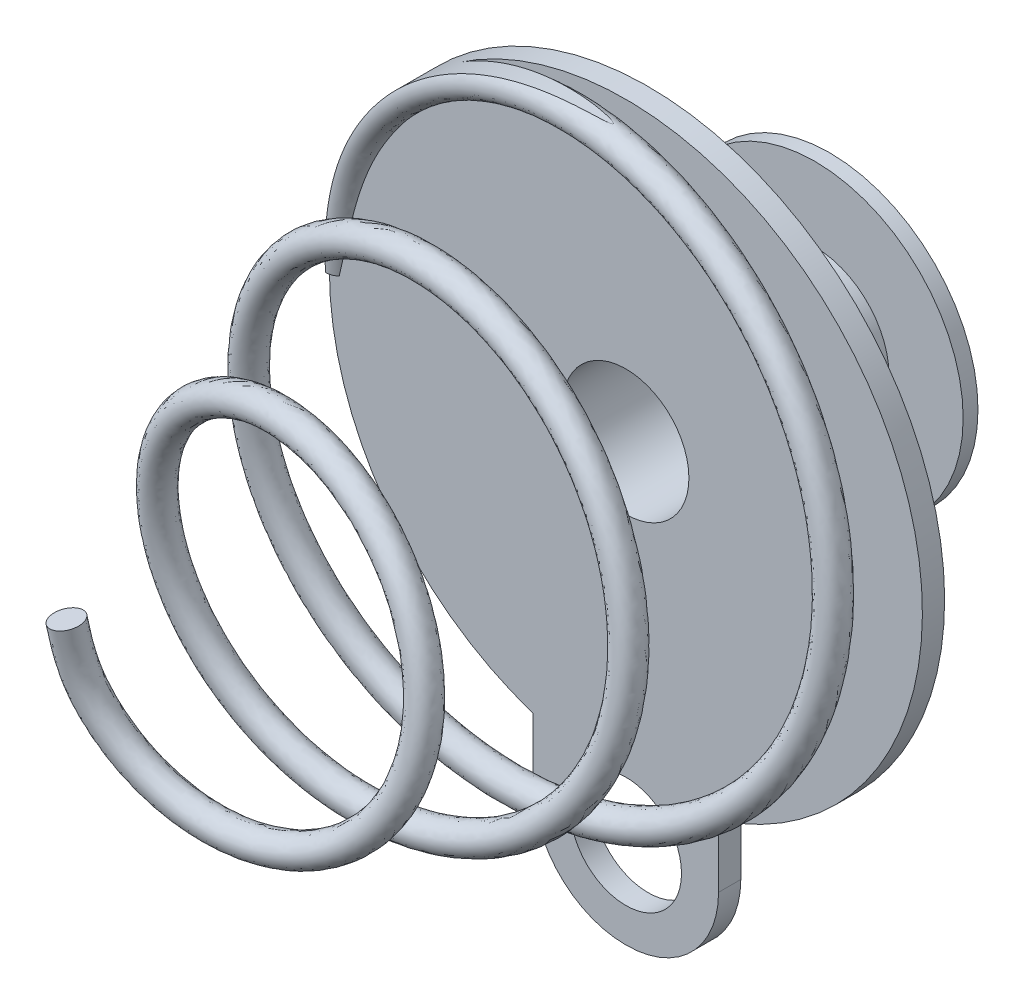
ISO-10303-21;
HEADER;
FILE_DESCRIPTION(('STEP AP214'),'2;1');
FILE_NAME('part.step','',(''),(''),'','','');
FILE_SCHEMA(('AUTOMOTIVE_DESIGN { 1 0 10303 214 1 1 1 1 }'));
ENDSEC;
DATA;
#1=APPLICATION_CONTEXT('core data for automotive mechanical design processes');
#2=APPLICATION_PROTOCOL_DEFINITION('international standard','automotive_design',2000,#1);
#3=PRODUCT_CONTEXT('',#1,'mechanical');
#4=PRODUCT('Part','Part','',(#3));
#5=PRODUCT_RELATED_PRODUCT_CATEGORY('part','',(#4));
#6=PRODUCT_DEFINITION_FORMATION('','',#4);
#7=PRODUCT_DEFINITION_CONTEXT('part definition',#1,'design');
#8=PRODUCT_DEFINITION('design','',#6,#7);
#9=PRODUCT_DEFINITION_SHAPE('','',#8);
#10=(LENGTH_UNIT() NAMED_UNIT(*) SI_UNIT(.MILLI.,.METRE.));
#11=(NAMED_UNIT(*) PLANE_ANGLE_UNIT() SI_UNIT($,.RADIAN.));
#12=(NAMED_UNIT(*) SI_UNIT($,.STERADIAN.) SOLID_ANGLE_UNIT());
#13=UNCERTAINTY_MEASURE_WITH_UNIT(LENGTH_MEASURE(1.E-05),#10,'distance_accuracy_value','');
#14=(GEOMETRIC_REPRESENTATION_CONTEXT(3) GLOBAL_UNCERTAINTY_ASSIGNED_CONTEXT((#13)) GLOBAL_UNIT_ASSIGNED_CONTEXT((#10,
#11,#12)) REPRESENTATION_CONTEXT('',''));
#15=CARTESIAN_POINT('',(0.,0.,0.));
#16=DIRECTION('',(0.,0.,1.));
#17=DIRECTION('',(1.,0.,0.));
#18=AXIS2_PLACEMENT_3D('',#15,#16,#17);
#19=CARTESIAN_POINT('',(0.,0.,-2.6));
#20=DIRECTION('',(0.,0.,1.));
#21=DIRECTION('',(1.,0.,0.));
#22=AXIS2_PLACEMENT_3D('',#19,#20,#21);
#23=CYLINDRICAL_SURFACE('',#22,1.);
#24=CARTESIAN_POINT('',(0.,0.,-0.15));
#25=DIRECTION('',(0.,0.,1.));
#26=DIRECTION('',(1.,0.,0.));
#27=AXIS2_PLACEMENT_3D('',#24,#25,#26);
#28=CIRCLE('',#27,1.);
#29=CARTESIAN_POINT('',(1.,0.,-0.15));
#30=VERTEX_POINT('',#29);
#31=EDGE_CURVE('E133',#30,#30,#28,.T.);
#32=ORIENTED_EDGE('',*,*,#31,.F.);
#33=EDGE_LOOP('',(#32));
#34=FACE_BOUND('',#33,.T.);
#35=CARTESIAN_POINT('',(0.,0.,-2.4));
#36=DIRECTION('',(0.,0.,-1.));
#37=DIRECTION('',(-1.,0.,0.));
#38=AXIS2_PLACEMENT_3D('',#35,#36,#37);
#39=CIRCLE('',#38,1.);
#40=CARTESIAN_POINT('',(-1.,0.,-2.4));
#41=VERTEX_POINT('',#40);
#42=EDGE_CURVE('E157',#41,#41,#39,.F.);
#43=ORIENTED_EDGE('',*,*,#42,.T.);
#44=EDGE_LOOP('',(#43));
#45=FACE_BOUND('',#44,.T.);
#46=ADVANCED_FACE('F31',(#34,#45),#23,.T.);
#47=CARTESIAN_POINT('',(0.,0.,-2.6));
#48=DIRECTION('',(0.,0.,1.));
#49=DIRECTION('',(1.,0.,0.));
#50=AXIS2_PLACEMENT_3D('',#47,#48,#49);
#51=CYLINDRICAL_SURFACE('',#50,0.85);
#52=CARTESIAN_POINT('',(0.,0.,0.15));
#53=DIRECTION('',(0.,0.,1.));
#54=DIRECTION('',(1.,0.,0.));
#55=AXIS2_PLACEMENT_3D('',#52,#53,#54);
#56=CIRCLE('',#55,0.85);
#57=CARTESIAN_POINT('',(0.85,0.,0.15));
#58=VERTEX_POINT('',#57);
#59=EDGE_CURVE('E153',#58,#58,#56,.T.);
#60=ORIENTED_EDGE('',*,*,#59,.T.);
#61=EDGE_LOOP('',(#60));
#62=FACE_BOUND('',#61,.T.);
#63=CARTESIAN_POINT('',(0.,0.,-2.6));
#64=DIRECTION('',(0.,0.,-1.));
#65=DIRECTION('',(-1.,0.,0.));
#66=AXIS2_PLACEMENT_3D('',#63,#64,#65);
#67=CIRCLE('',#66,0.85);
#68=CARTESIAN_POINT('',(-0.85,0.,-2.6));
#69=VERTEX_POINT('',#68);
#70=EDGE_CURVE('E423',#69,#69,#67,.T.);
#71=ORIENTED_EDGE('',*,*,#70,.T.);
#72=EDGE_LOOP('',(#71));
#73=FACE_BOUND('',#72,.T.);
#74=ADVANCED_FACE('F248',(#62,#73),#51,.F.);
#75=CARTESIAN_POINT('',(0.,0.,0.15));
#76=DIRECTION('',(0.,0.,1.));
#77=DIRECTION('',(1.,0.,0.));
#78=AXIS2_PLACEMENT_3D('',#75,#76,#77);
#79=PLANE('',#78);
#80=CARTESIAN_POINT('',(0.,-4.66999601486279,0.15));
#81=DIRECTION('',(0.,0.,1.));
#82=DIRECTION('',(1.,0.,0.));
#83=AXIS2_PLACEMENT_3D('',#80,#81,#82);
#84=CIRCLE('',#83,0.75);
#85=CARTESIAN_POINT('',(0.75,-4.66999601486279,0.15));
#86=VERTEX_POINT('',#85);
#87=EDGE_CURVE('E420',#86,#86,#84,.T.);
#88=ORIENTED_EDGE('',*,*,#87,.F.);
#89=EDGE_LOOP('',(#88));
#90=FACE_BOUND('',#89,.T.);
#91=ORIENTED_EDGE('',*,*,#59,.F.);
#92=EDGE_LOOP('',(#91));
#93=FACE_BOUND('',#92,.T.);
#94=DIRECTION('',(0.,1.,0.));
#95=VECTOR('',#94,1.);
#96=CARTESIAN_POINT('',(1.25,0.,0.15));
#97=LINE('',#96,#95);
#98=CARTESIAN_POINT('',(1.25,-4.64026576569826,0.150000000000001));
#99=VERTEX_POINT('',#98);
#100=CARTESIAN_POINT('',(1.25,-3.79967103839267,0.150000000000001));
#101=VERTEX_POINT('',#100);
#102=EDGE_CURVE('E225',#99,#101,#97,.T.);
#103=ORIENTED_EDGE('',*,*,#102,.T.);
#104=CARTESIAN_POINT('',(0.,0.,0.15));
#105=DIRECTION('',(0.,0.,1.));
#106=DIRECTION('',(1.,0.,0.));
#107=AXIS2_PLACEMENT_3D('',#104,#105,#106);
#108=CIRCLE('',#107,4.);
#109=CARTESIAN_POINT('',(-2.26457137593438,3.29722860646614,0.149999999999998));
#110=VERTEX_POINT('',#109);
#111=EDGE_CURVE('E220',#101,#110,#108,.T.);
#112=ORIENTED_EDGE('',*,*,#111,.T.);
#113=CARTESIAN_POINT('',(-3.99999999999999,1.04414830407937,0.15));
#114=CARTESIAN_POINT('',(-3.99282968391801,1.07563880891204,0.150000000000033));
#115=CARTESIAN_POINT('',(-3.9853004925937,1.10704842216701,0.150000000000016));
#116=CARTESIAN_POINT('',(-3.96948688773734,1.16967342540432,0.149999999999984));
#117=CARTESIAN_POINT('',(-3.96120254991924,1.20088883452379,0.149999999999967));
#118=CARTESIAN_POINT('',(-3.94383414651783,1.26311941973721,0.150000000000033));
#119=CARTESIAN_POINT('',(-3.9347495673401,1.29413445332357,0.150000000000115));
#120=CARTESIAN_POINT('',(-3.91574353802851,1.35591189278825,0.149999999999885));
#121=CARTESIAN_POINT('',(-3.90582190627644,1.38667424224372,0.149999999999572));
#122=CARTESIAN_POINT('',(-3.8674718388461,1.5000262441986,0.149999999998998));
#123=CARTESIAN_POINT('',(-3.83628429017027,1.58171885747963,0.149999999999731));
#124=CARTESIAN_POINT('',(-3.76666571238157,1.74197543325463,0.150000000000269));
#125=CARTESIAN_POINT('',(-3.72823317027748,1.82053873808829,0.150000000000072));
#126=CARTESIAN_POINT('',(-3.64479141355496,1.97427386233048,0.149999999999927));
#127=CARTESIAN_POINT('',(-3.59976923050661,2.04943860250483,0.149999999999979));
#128=CARTESIAN_POINT('',(-3.50394634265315,2.19599716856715,0.150000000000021));
#129=CARTESIAN_POINT('',(-3.45314439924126,2.26739018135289,0.150000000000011));
#130=CARTESIAN_POINT('',(-3.34534686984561,2.40759393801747,0.149999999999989));
#131=CARTESIAN_POINT('',(-3.28824854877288,2.47632554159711,0.149999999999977));
#132=CARTESIAN_POINT('',(-3.16911728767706,2.60937089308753,0.150000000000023));
#133=CARTESIAN_POINT('',(-3.10708438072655,2.67368467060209,0.150000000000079));
#134=CARTESIAN_POINT('',(-2.9785127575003,2.79733523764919,0.149999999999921));
#135=CARTESIAN_POINT('',(-2.91198453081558,2.8566829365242,0.149999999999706));
#136=CARTESIAN_POINT('',(-2.774623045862,2.97013839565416,0.150000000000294));
#137=CARTESIAN_POINT('',(-2.7037913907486,3.02424808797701,0.150000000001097));
#138=CARTESIAN_POINT('',(-2.5908185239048,3.10363635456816,0.150000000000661));
#139=CARTESIAN_POINT('',(-2.55009031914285,3.13094288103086,0.150000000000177));
#140=CARTESIAN_POINT('',(-2.46740049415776,3.18363708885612,0.149999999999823));
#141=CARTESIAN_POINT('',(-2.42543878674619,3.209024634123,0.149999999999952));
#142=CARTESIAN_POINT('',(-2.3401579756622,3.25773727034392,0.150000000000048));
#143=CARTESIAN_POINT('',(-2.2968350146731,3.28105561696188,0.150000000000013));
#144=CARTESIAN_POINT('',(-2.20895349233,3.32520670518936,0.149999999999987));
#145=CARTESIAN_POINT('',(-2.16439558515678,3.3460407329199,0.149999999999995));
#146=CARTESIAN_POINT('',(-2.09651676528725,3.37498130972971,0.150000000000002));
#147=CARTESIAN_POINT('',(-2.07369083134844,3.38425212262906,0.150000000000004));
#148=CARTESIAN_POINT('',(-2.02766773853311,3.40186162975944,0.149999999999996));
#149=CARTESIAN_POINT('',(-2.00447040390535,3.41019986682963,0.149999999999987));
#150=CARTESIAN_POINT('',(-1.95782897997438,3.42563892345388,0.150000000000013));
#151=CARTESIAN_POINT('',(-1.93438760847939,3.43274770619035,0.150000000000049));
#152=CARTESIAN_POINT('',(-1.89886918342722,3.44208046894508,0.149999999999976));
#153=CARTESIAN_POINT('',(-1.88696719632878,3.44497022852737,0.14999999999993));
#154=CARTESIAN_POINT('',(-1.86303334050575,3.45013949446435,0.15000000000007));
#155=CARTESIAN_POINT('',(-1.85100157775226,3.4524194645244,0.150000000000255));
#156=CARTESIAN_POINT('',(-1.83087322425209,3.45540348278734,0.149999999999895));
#157=CARTESIAN_POINT('',(-1.82281702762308,3.45637968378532,0.149999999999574));
#158=CARTESIAN_POINT('',(-1.80666017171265,3.45768042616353,0.150000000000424));
#159=CARTESIAN_POINT('',(-1.79855973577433,3.4580070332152,0.150000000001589));
#160=CARTESIAN_POINT('',(-1.78639393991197,3.45753761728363,0.1500000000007));
#161=CARTESIAN_POINT('',(-1.7823156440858,3.45721719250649,0.149999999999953));
#162=CARTESIAN_POINT('',(-1.77424581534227,3.45604790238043,0.150000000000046));
#163=CARTESIAN_POINT('',(-1.77025394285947,3.45520177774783,0.150000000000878));
#164=CARTESIAN_POINT('',(-1.76332451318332,3.45277828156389,0.150000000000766));
#165=CARTESIAN_POINT('',(-1.76033650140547,3.45138243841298,0.150000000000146));
#166=CARTESIAN_POINT('',(-1.75610573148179,3.448213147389,0.14999999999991));
#167=CARTESIAN_POINT('',(-1.75462966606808,3.44678036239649,0.150000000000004));
#168=CARTESIAN_POINT('',(-1.7522854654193,3.44344941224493,0.149999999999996));
#169=CARTESIAN_POINT('',(-1.75142136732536,3.44154826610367,0.149999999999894));
#170=CARTESIAN_POINT('',(-1.7504835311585,3.43777716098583,0.150000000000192));
#171=CARTESIAN_POINT('',(-1.7503405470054,3.43592245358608,0.150000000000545));
#172=CARTESIAN_POINT('',(-1.75053843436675,3.43083224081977,0.150000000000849));
#173=CARTESIAN_POINT('',(-1.75133538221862,3.42763052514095,0.150000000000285));
#174=CARTESIAN_POINT('',(-1.75392554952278,3.42038001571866,0.149999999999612));
#175=CARTESIAN_POINT('',(-1.75597464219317,3.41644294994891,0.149999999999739));
#176=CARTESIAN_POINT('',(-1.76056678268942,3.4088483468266,0.150000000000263));
#177=CARTESIAN_POINT('',(-1.7631132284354,3.40519298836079,0.150000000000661));
#178=CARTESIAN_POINT('',(-1.77161395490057,3.39390439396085,0.150000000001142));
#179=CARTESIAN_POINT('',(-1.77805488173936,3.38664718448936,0.150000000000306));
#180=CARTESIAN_POINT('',(-1.79141476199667,3.37258203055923,0.149999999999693));
#181=CARTESIAN_POINT('',(-1.7983349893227,3.36577538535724,0.149999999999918));
#182=CARTESIAN_POINT('',(-1.81244888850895,3.3524394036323,0.150000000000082));
#183=CARTESIAN_POINT('',(-1.81964274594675,3.34591026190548,0.150000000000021));
#184=CARTESIAN_POINT('',(-1.83417691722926,3.33304198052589,0.149999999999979));
#185=CARTESIAN_POINT('',(-1.84151699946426,3.32670257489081,0.149999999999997));
#186=CARTESIAN_POINT('',(-1.86350453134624,3.30801691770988,0.150000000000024));
#187=CARTESIAN_POINT('',(-1.87829726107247,3.29584196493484,0.150000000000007));
#188=CARTESIAN_POINT('',(-1.90805516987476,3.27170417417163,0.149999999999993));
#189=CARTESIAN_POINT('',(-1.92302036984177,3.25974136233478,0.149999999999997));
#190=CARTESIAN_POINT('',(-1.96803929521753,3.22396299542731,0.150000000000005));
#191=CARTESIAN_POINT('',(-1.99819445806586,3.2002753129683,0.150000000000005));
#192=CARTESIAN_POINT('',(-2.05834933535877,3.15277813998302,0.149999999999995));
#193=CARTESIAN_POINT('',(-2.0883491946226,3.12896883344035,0.149999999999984));
#194=CARTESIAN_POINT('',(-2.1480599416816,3.08100161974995,0.150000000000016));
#195=CARTESIAN_POINT('',(-2.17777088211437,3.05684377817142,0.150000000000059));
#196=CARTESIAN_POINT('',(-2.26464960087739,2.98503221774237,0.150000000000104));
#197=CARTESIAN_POINT('',(-2.32127529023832,2.93671461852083,0.150000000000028));
#198=CARTESIAN_POINT('',(-2.43259833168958,2.83791014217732,0.149999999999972));
#199=CARTESIAN_POINT('',(-2.48729561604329,2.78742318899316,0.14999999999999));
#200=CARTESIAN_POINT('',(-2.64812587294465,2.63236190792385,0.15000000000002));
#201=CARTESIAN_POINT('',(-2.75092588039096,2.52424490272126,0.150000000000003));
#202=CARTESIAN_POINT('',(-2.89664927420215,2.35518057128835,0.149999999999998));
#203=CARTESIAN_POINT('',(-2.94373725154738,2.29778221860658,0.15));
#204=CARTESIAN_POINT('',(-3.03496530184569,2.18069150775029,0.15));
#205=CARTESIAN_POINT('',(-3.07910509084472,2.12099892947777,0.149999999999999));
#206=CARTESIAN_POINT('',(-3.20630314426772,1.93849194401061,0.150000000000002));
#207=CARTESIAN_POINT('',(-3.2843397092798,1.81202091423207,0.150000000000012));
#208=CARTESIAN_POINT('',(-3.37052220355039,1.64884301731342,0.149999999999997));
#209=CARTESIAN_POINT('',(-3.3869767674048,1.61640518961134,0.149999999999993));
#210=CARTESIAN_POINT('',(-3.41876164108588,1.55098309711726,0.150000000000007));
#211=CARTESIAN_POINT('',(-3.43409203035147,1.51799887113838,0.150000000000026));
#212=CARTESIAN_POINT('',(-3.47845311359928,1.4183285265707,0.149999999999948));
#213=CARTESIAN_POINT('',(-3.50585850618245,1.35091564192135,0.149999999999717));
#214=CARTESIAN_POINT('',(-3.5569040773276,1.21462750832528,0.150000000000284));
#215=CARTESIAN_POINT('',(-3.58054067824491,1.14575093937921,0.150000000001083));
#216=CARTESIAN_POINT('',(-3.62466132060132,1.00699862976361,0.149999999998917));
#217=CARTESIAN_POINT('',(-3.64514510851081,0.937122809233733,0.149999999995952));
#218=CARTESIAN_POINT('',(-3.69111190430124,0.769266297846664,0.14999999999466));
#219=CARTESIAN_POINT('',(-3.7154221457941,0.670969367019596,0.149999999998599));
#220=CARTESIAN_POINT('',(-3.76154048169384,0.473873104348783,0.150000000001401));
#221=CARTESIAN_POINT('',(-3.78334990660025,0.375074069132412,0.150000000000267));
#222=CARTESIAN_POINT('',(-3.81540232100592,0.230186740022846,0.149999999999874));
#223=CARTESIAN_POINT('',(-3.82561001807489,0.184091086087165,0.149999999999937));
#224=CARTESIAN_POINT('',(-3.84634571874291,0.0919734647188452,0.150000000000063));
#225=CARTESIAN_POINT('',(-3.85687371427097,0.0459514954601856,0.150000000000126));
#226=CARTESIAN_POINT('',(-3.86771243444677,0.,0.15));
#227=B_SPLINE_CURVE_WITH_KNOTS('',3,(#113,#114,#115,#116,#117,#118,#119,#120,#121,#122,#123,
#124,#125,#126,#127,#128,#129,#130,#131,#132,#133,#134,#135,#136,#137,#138,#139,#140,#141,#142,
#143,#144,#145,#146,#147,#148,#149,#150,#151,#152,#153,#154,#155,#156,#157,#158,#159,#160,#161,
#162,#163,#164,#165,#166,#167,#168,#169,#170,#171,#172,#173,#174,#175,#176,#177,#178,#179,#180,
#181,#182,#183,#184,#185,#186,#187,#188,#189,#190,#191,#192,#193,#194,#195,#196,#197,#198,#199,
#200,#201,#202,#203,#204,#205,#206,#207,#208,#209,#210,#211,#212,#213,#214,#215,#216,#217,#218,
#219,#220,#221,#222,#223,#224,#225,#226),.UNSPECIFIED.,.F.,.F.,(4,2,2,2,2,2,2,2,2,2,2,2,2,2,2,2,
2,2,2,2,2,2,2,2,2,2,2,2,2,2,2,2,2,2,2,2,2,2,2,2,2,2,2,2,2,2,2,2,2,2,2,2,2,2,2,2,4),(0.,
0.0968884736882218,0.193767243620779,0.290708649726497,0.387671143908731,0.649653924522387,
0.911691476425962,1.17425183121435,1.43686855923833,1.70468618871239,1.97250202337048,
2.23971317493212,2.50682538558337,2.65388739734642,2.80095982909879,2.94849525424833,
3.09595396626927,3.16984807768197,3.24377825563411,3.31721002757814,3.35394487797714,
3.39065171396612,3.41498736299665,3.4392455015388,3.45149819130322,3.46368753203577,
3.47342268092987,3.4794882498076,3.48559346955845,3.49109949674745,3.50083524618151,
3.51408741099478,3.52743349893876,3.55647093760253,3.58558875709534,3.61472668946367,
3.64382165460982,3.70129142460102,3.75876823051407,3.87380648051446,3.98870430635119,
4.10358079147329,4.32683989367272,4.55010683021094,4.99691530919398,5.21955531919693,
5.44221674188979,5.88663587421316,5.99574118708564,6.10483878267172,6.32300319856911,
6.54137349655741,6.75976134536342,7.06345712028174,7.36699056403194,7.50862683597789,
7.65025954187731),.UNSPECIFIED.);
#228=CARTESIAN_POINT('',(-3.86771243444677,0.,0.15));
#229=VERTEX_POINT('',#228);
#230=EDGE_CURVE('E139',#110,#229,#227,.T.);
#231=ORIENTED_EDGE('',*,*,#230,.T.);
#232=DIRECTION('',(1.,0.,0.));
#233=VECTOR('',#232,1.);
#234=CARTESIAN_POINT('',(-4.,0.,0.15));
#235=LINE('',#234,#233);
#236=CARTESIAN_POINT('',(-4.,0.,0.150000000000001));
#237=VERTEX_POINT('',#236);
#238=EDGE_CURVE('E216',#237,#229,#235,.T.);
#239=ORIENTED_EDGE('',*,*,#238,.F.);
#240=CARTESIAN_POINT('',(0.,0.,0.150000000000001));
#241=DIRECTION('',(0.,0.,1.));
#242=DIRECTION('',(1.,0.,0.));
#243=AXIS2_PLACEMENT_3D('',#240,#241,#242);
#244=CIRCLE('',#243,4.);
#245=CARTESIAN_POINT('',(-1.25,-3.79967103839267,0.150000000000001));
#246=VERTEX_POINT('',#245);
#247=EDGE_CURVE('E178',#237,#246,#244,.T.);
#248=ORIENTED_EDGE('',*,*,#247,.T.);
#249=DIRECTION('',(0.,-1.,0.));
#250=VECTOR('',#249,1.);
#251=CARTESIAN_POINT('',(-1.25,0.,0.15));
#252=LINE('',#251,#250);
#253=CARTESIAN_POINT('',(-1.25,-4.64026576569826,0.150000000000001));
#254=VERTEX_POINT('',#253);
#255=EDGE_CURVE('E131',#246,#254,#252,.T.);
#256=ORIENTED_EDGE('',*,*,#255,.T.);
#257=CARTESIAN_POINT('',(-0.01,-4.64026576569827,0.150000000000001));
#258=DIRECTION('',(0.,0.,1.));
#259=DIRECTION('',(1.,0.,0.));
#260=AXIS2_PLACEMENT_3D('',#257,#258,#259);
#261=CIRCLE('',#260,1.24);
#262=CARTESIAN_POINT('',(-0.00999999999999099,-5.88026576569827,0.150000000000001));
#263=VERTEX_POINT('',#262);
#264=EDGE_CURVE('E233',#254,#263,#261,.T.);
#265=ORIENTED_EDGE('',*,*,#264,.T.);
#266=DIRECTION('',(1.,0.,0.));
#267=VECTOR('',#266,1.);
#268=CARTESIAN_POINT('',(0.,-5.88026576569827,0.15));
#269=LINE('',#268,#267);
#270=CARTESIAN_POINT('',(0.00999999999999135,-5.88026576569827,0.150000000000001));
#271=VERTEX_POINT('',#270);
#272=EDGE_CURVE('E231',#263,#271,#269,.T.);
#273=ORIENTED_EDGE('',*,*,#272,.T.);
#274=CARTESIAN_POINT('',(0.01,-4.64026576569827,0.150000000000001));
#275=DIRECTION('',(0.,0.,1.));
#276=DIRECTION('',(1.,0.,0.));
#277=AXIS2_PLACEMENT_3D('',#274,#275,#276);
#278=CIRCLE('',#277,1.24);
#279=EDGE_CURVE('E228',#271,#99,#278,.T.);
#280=ORIENTED_EDGE('',*,*,#279,.T.);
#281=EDGE_LOOP('',(#103,#112,#231,#239,#248,#256,#265,#273,#280));
#282=FACE_BOUND('',#281,.T.);
#283=ADVANCED_FACE('F203',(#90,#93,#282),#79,.T.);
#284=CARTESIAN_POINT('',(-4.,0.,0.));
#285=DIRECTION('',(0.,1.,0.));
#286=DIRECTION('',(0.,0.,1.));
#287=AXIS2_PLACEMENT_3D('',#284,#285,#286);
#288=PLANE('',#287);
#289=DIRECTION('',(0.,0.,1.));
#290=VECTOR('',#289,1.);
#291=CARTESIAN_POINT('',(-4.,0.,-15.));
#292=LINE('',#291,#290);
#293=CARTESIAN_POINT('',(-4.,0.,-0.2));
#294=VERTEX_POINT('',#293);
#295=CARTESIAN_POINT('',(-4.,0.,-0.150000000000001));
#296=VERTEX_POINT('',#295);
#297=EDGE_CURVE('E120',#294,#296,#292,.T.);
#298=ORIENTED_EDGE('',*,*,#297,.F.);
#299=CARTESIAN_POINT('',(-4.,0.,0.));
#300=DIRECTION('',(0.,1.,0.));
#301=DIRECTION('',(0.,0.,1.));
#302=AXIS2_PLACEMENT_3D('',#299,#300,#301);
#303=CIRCLE('',#302,0.2);
#304=CARTESIAN_POINT('',(-3.86771243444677,0.,-0.15));
#305=VERTEX_POINT('',#304);
#306=EDGE_CURVE('E210',#305,#294,#303,.T.);
#307=ORIENTED_EDGE('',*,*,#306,.F.);
#308=DIRECTION('',(1.,0.,0.));
#309=VECTOR('',#308,1.);
#310=CARTESIAN_POINT('',(-4.,0.,-0.15));
#311=LINE('',#310,#309);
#312=EDGE_CURVE('E48',#296,#305,#311,.T.);
#313=ORIENTED_EDGE('',*,*,#312,.F.);
#314=EDGE_LOOP('',(#298,#307,#313));
#315=FACE_BOUND('',#314,.T.);
#316=ADVANCED_FACE('F33',(#315),#288,.F.);
#317=CARTESIAN_POINT('',(-4.,0.,0.200000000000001));
#318=VERTEX_POINT('',#317);
#319=EDGE_CURVE('E122',#237,#318,#292,.T.);
#320=ORIENTED_EDGE('',*,*,#319,.F.);
#321=ORIENTED_EDGE('',*,*,#238,.T.);
#322=EDGE_CURVE('E56',#318,#229,#303,.T.);
#323=ORIENTED_EDGE('',*,*,#322,.F.);
#324=EDGE_LOOP('',(#320,#321,#323));
#325=FACE_BOUND('',#324,.T.);
#326=ADVANCED_FACE('F239',(#325),#288,.F.);
#327=CARTESIAN_POINT('',(-4.,0.,0.2));
#328=CARTESIAN_POINT('',(-3.95955414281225,0.278530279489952,0.22231873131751));
#329=CARTESIAN_POINT('',(-3.88019416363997,0.831714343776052,0.266636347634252));
#330=CARTESIAN_POINT('',(-3.63186594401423,1.63967999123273,0.33515891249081));
#331=CARTESIAN_POINT('',(-3.17585543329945,2.35401811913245,0.403186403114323));
#332=CARTESIAN_POINT('',(-2.57881752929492,2.95453459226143,0.471251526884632));
#333=CARTESIAN_POINT('',(-1.8694536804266,3.41853640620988,0.540499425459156));
#334=CARTESIAN_POINT('',(-1.07763703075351,3.7169636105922,0.610139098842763));
#335=CARTESIAN_POINT('',(-0.239708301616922,3.83635074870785,0.680021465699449));
#336=CARTESIAN_POINT('',(0.604434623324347,3.76840666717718,0.750499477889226));
#337=CARTESIAN_POINT('',(1.41293679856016,3.51674324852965,0.821507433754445));
#338=CARTESIAN_POINT('',(2.14482614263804,3.09100035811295,0.892996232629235));
#339=CARTESIAN_POINT('',(2.7635727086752,2.51298302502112,0.96502426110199));
#340=CARTESIAN_POINT('',(3.22775405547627,1.82173380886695,1.03635330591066));
#341=CARTESIAN_POINT('',(3.52203069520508,1.05905829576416,1.1069765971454));
#342=CARTESIAN_POINT('',(3.64188736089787,0.264691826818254,1.17685270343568));
#343=CARTESIAN_POINT('',(3.58434158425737,-0.536572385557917,1.24726413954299));
#344=CARTESIAN_POINT('',(3.3524923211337,-1.30575421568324,1.31819259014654));
#345=CARTESIAN_POINT('',(2.95473931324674,-2.00378317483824,1.38966023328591));
#346=CARTESIAN_POINT('',(2.41158475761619,-2.5957288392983,1.46169312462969));
#347=CARTESIAN_POINT('',(1.74856085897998,-3.04955487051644,1.53426884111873));
#348=CARTESIAN_POINT('',(0.99987177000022,-3.34100716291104,1.60745051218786));
#349=CARTESIAN_POINT('',(0.204299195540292,-3.4536226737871,1.68120053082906));
#350=CARTESIAN_POINT('',(-0.595715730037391,-3.37885024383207,1.75557237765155));
#351=CARTESIAN_POINT('',(-1.35663811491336,-3.12074226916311,1.83056704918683));
#352=CARTESIAN_POINT('',(-2.03548153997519,-2.69069885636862,1.90618545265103));
#353=CARTESIAN_POINT('',(-2.59341536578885,-2.11243398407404,1.9824822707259));
#354=CARTESIAN_POINT('',(-2.99752872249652,-1.41778085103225,2.05943085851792));
#355=CARTESIAN_POINT('',(-3.22190496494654,-0.646127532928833,2.13707338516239));
#356=CARTESIAN_POINT('',(-3.25161239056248,0.127464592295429,2.21256402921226));
#357=CARTESIAN_POINT('',(-3.10699729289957,0.855979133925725,2.28571262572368));
#358=CARTESIAN_POINT('',(-2.81761493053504,1.50790160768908,2.35658192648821));
#359=CARTESIAN_POINT('',(-2.39099870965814,2.07952927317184,2.42802660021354));
#360=CARTESIAN_POINT('',(-1.84686186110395,2.54069240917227,2.50011159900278));
#361=CARTESIAN_POINT('',(-1.21301058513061,2.86777358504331,2.57282750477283));
#362=CARTESIAN_POINT('',(-0.5211081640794,3.04122326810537,2.64619065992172));
#363=CARTESIAN_POINT('',(0.192083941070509,3.0515155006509,2.72024628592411));
#364=CARTESIAN_POINT('',(0.888273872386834,2.89605399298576,2.79496729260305));
#365=CARTESIAN_POINT('',(1.52858106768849,2.58171231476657,2.87042224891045));
#366=CARTESIAN_POINT('',(2.07688154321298,2.12543639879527,2.94659753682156));
#367=CARTESIAN_POINT('',(2.50009608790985,1.5511735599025,3.02352034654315));
#368=CARTESIAN_POINT('',(2.77279333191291,0.892036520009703,3.10123988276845));
#369=CARTESIAN_POINT('',(2.87713019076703,0.186353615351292,3.17973051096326));
#370=CARTESIAN_POINT('',(2.80692690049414,-0.497262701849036,3.25615512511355));
#371=CARTESIAN_POINT('',(2.58805098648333,-1.11904809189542,3.33033128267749));
#372=CARTESIAN_POINT('',(2.24949422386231,-1.65401623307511,3.40224583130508));
#373=CARTESIAN_POINT('',(1.79919582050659,-2.09892721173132,3.47489438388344));
#374=CARTESIAN_POINT('',(1.25947859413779,-2.42976811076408,3.54825053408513));
#375=CARTESIAN_POINT('',(0.658030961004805,-2.6272073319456,3.62238413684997));
#376=CARTESIAN_POINT('',(0.0272463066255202,-2.68003573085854,3.69728969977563));
#377=CARTESIAN_POINT('',(-0.598271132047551,-2.58284850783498,3.77299294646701));
#378=CARTESIAN_POINT('',(-1.18288773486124,-2.34022520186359,3.84954880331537));
#379=CARTESIAN_POINT('',(-1.69234220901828,-1.96455269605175,3.92693978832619));
#380=CARTESIAN_POINT('',(-2.09514081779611,-1.47627936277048,4.00523504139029));
#381=CARTESIAN_POINT('',(-2.36618506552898,-0.904334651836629,4.08445252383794));
#382=CARTESIAN_POINT('',(-2.48668149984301,-0.282956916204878,4.16460469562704));
#383=CARTESIAN_POINT('',(-2.44705540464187,0.34874042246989,4.24576909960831));
#384=CARTESIAN_POINT('',(-2.24852248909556,0.949592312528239,4.32793691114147));
#385=CARTESIAN_POINT('',(-1.93033490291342,1.43531523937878,4.4042982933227));
#386=CARTESIAN_POINT('',(-1.54979578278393,1.79689934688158,4.47442894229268));
#387=CARTESIAN_POINT('',(-1.14937720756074,2.04834591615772,4.53822010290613));
#388=CARTESIAN_POINT('',(-0.706628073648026,2.21405008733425,4.60269570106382));
#389=CARTESIAN_POINT('',(-0.239605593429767,2.28696946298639,4.66782485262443));
#390=CARTESIAN_POINT('',(0.232399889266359,2.26230722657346,4.73368666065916));
#391=CARTESIAN_POINT('',(0.689124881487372,2.14096549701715,4.8002500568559));
#392=CARTESIAN_POINT('',(1.11009509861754,1.92630368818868,4.8675858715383));
#393=CARTESIAN_POINT('',(1.47634963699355,1.62787147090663,4.93568569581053));
#394=CARTESIAN_POINT('',(1.76987626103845,1.25770088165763,5.00459422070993));
#395=CARTESIAN_POINT('',(1.97645661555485,0.832957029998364,5.07434448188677));
#396=CARTESIAN_POINT('',(2.08484953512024,0.373315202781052,5.14493689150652));
#397=CARTESIAN_POINT('',(2.08828640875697,-0.0815187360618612,5.21383128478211));
#398=CARTESIAN_POINT('',(1.99896994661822,-0.508696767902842,5.28081616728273));
#399=CARTESIAN_POINT('',(1.83174079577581,-0.892925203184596,5.34594136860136));
#400=CARTESIAN_POINT('',(1.58967030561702,-1.23482790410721,5.41181809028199));
#401=CARTESIAN_POINT('',(1.281728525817,-1.51878461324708,5.47854763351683));
#402=CARTESIAN_POINT('',(0.921425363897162,-1.732116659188,5.5460873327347));
#403=CARTESIAN_POINT('',(0.523884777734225,-1.86350543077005,5.61455451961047));
#404=CARTESIAN_POINT('',(0.107425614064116,-1.90625636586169,5.68394297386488));
#405=CARTESIAN_POINT('',(-0.308113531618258,-1.85744169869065,5.75418312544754));
#406=CARTESIAN_POINT('',(-0.70276124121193,-1.71905175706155,5.82544460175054));
#407=CARTESIAN_POINT('',(-1.05384131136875,-1.49083706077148,5.89815976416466));
#408=CARTESIAN_POINT('',(-1.34684599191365,-1.19313319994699,5.97139603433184));
#409=CARTESIAN_POINT('',(-1.57409379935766,-0.840994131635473,6.04504905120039));
#410=CARTESIAN_POINT('',(-1.67196014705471,-0.433928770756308,6.12242305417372));
#411=CARTESIAN_POINT('',(-1.68138576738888,-0.158676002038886,6.17320315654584));
#412=CARTESIAN_POINT('',(-1.68759339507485,-0.0201802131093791,6.19876545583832));
#413=CARTESIAN_POINT('',(-3.6,0.,0.2));
#414=CARTESIAN_POINT('',(-3.55951483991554,0.278800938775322,0.222340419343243));
#415=CARTESIAN_POINT('',(-3.47849824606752,0.816170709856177,0.265779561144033));
#416=CARTESIAN_POINT('',(-3.24385775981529,1.52418171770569,0.3251039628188));
#417=CARTESIAN_POINT('',(-2.8299265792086,2.14690012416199,0.395710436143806));
#418=CARTESIAN_POINT('',(-2.28147475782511,2.68305671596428,0.467385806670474));
#419=CARTESIAN_POINT('',(-1.63562609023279,3.08999739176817,0.534510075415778));
#420=CARTESIAN_POINT('',(-0.922714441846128,3.34471341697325,0.603503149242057));
#421=CARTESIAN_POINT('',(-0.168582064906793,3.43949322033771,0.674353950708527));
#422=CARTESIAN_POINT('',(0.585833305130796,3.36552080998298,0.744727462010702));
#423=CARTESIAN_POINT('',(1.30592116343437,3.12793259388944,0.815529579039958));
#424=CARTESIAN_POINT('',(1.95384209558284,2.73565748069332,0.887352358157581));
#425=CARTESIAN_POINT('',(2.4972567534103,2.21000690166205,0.959155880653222));
#426=CARTESIAN_POINT('',(2.90127295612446,1.58493039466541,1.03085118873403));
#427=CARTESIAN_POINT('',(3.15115608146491,0.90095927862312,1.10124479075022));
#428=CARTESIAN_POINT('',(3.24561741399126,0.190235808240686,1.17140195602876));
#429=CARTESIAN_POINT('',(3.18133068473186,-0.521321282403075,1.24174615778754));
#430=CARTESIAN_POINT('',(2.96272341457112,-1.20225425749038,1.31270041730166));
#431=CARTESIAN_POINT('',(2.59778063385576,-1.81581585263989,1.38438833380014));
#432=CARTESIAN_POINT('',(2.10626186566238,-2.33210199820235,1.45619730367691));
#433=CARTESIAN_POINT('',(1.51012483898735,-2.72403536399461,1.52917377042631));
#434=CARTESIAN_POINT('',(0.84283776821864,-2.9692691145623,1.60213166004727));
#435=CARTESIAN_POINT('',(0.136030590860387,-3.05587189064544,1.67613218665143));
#436=CARTESIAN_POINT('',(-0.569346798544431,-2.97599211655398,1.75055547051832));
#437=CARTESIAN_POINT('',(-1.23681777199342,-2.7352604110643,1.8254023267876));
#438=CARTESIAN_POINT('',(-1.82859039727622,-2.34389968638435,1.90142199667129));
#439=CARTESIAN_POINT('',(-2.30939562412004,-1.82530910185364,1.97751058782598));
#440=CARTESIAN_POINT('',(-2.65337081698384,-1.2064064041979,2.05468284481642));
#441=CARTESIAN_POINT('',(-2.83655323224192,-0.524534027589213,2.13246154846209));
#442=CARTESIAN_POINT('',(-2.84893327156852,0.154525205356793,2.20774741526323));
#443=CARTESIAN_POINT('',(-2.70891302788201,0.791373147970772,2.28133895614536));
#444=CARTESIAN_POINT('',(-2.44400151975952,1.35595715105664,2.3519619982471));
#445=CARTESIAN_POINT('',(-2.06005946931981,1.84891216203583,2.42371742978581));
#446=CARTESIAN_POINT('',(-1.57672945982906,2.24096902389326,2.49580851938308));
#447=CARTESIAN_POINT('',(-1.01761838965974,2.51477939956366,2.56843391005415));
#448=CARTESIAN_POINT('',(-0.411490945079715,2.65276312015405,2.64220536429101));
#449=CARTESIAN_POINT('',(0.208382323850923,2.64822348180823,2.71597745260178));
#450=CARTESIAN_POINT('',(0.811053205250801,2.49979634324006,2.79113188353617));
#451=CARTESIAN_POINT('',(1.35953040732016,2.21496764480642,2.86651374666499));
#452=CARTESIAN_POINT('',(1.82593219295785,1.80906620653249,2.94266192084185));
#453=CARTESIAN_POINT('',(2.18054163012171,1.30398394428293,3.01999530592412));
#454=CARTESIAN_POINT('',(2.40260899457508,0.730199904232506,3.09747919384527));
#455=CARTESIAN_POINT('',(2.47867560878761,0.119104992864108,3.17630547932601));
#456=CARTESIAN_POINT('',(2.40424286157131,-0.467148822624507,3.2528736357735));
#457=CARTESIAN_POINT('',(2.20373007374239,-0.996657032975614,3.32680913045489));
#458=CARTESIAN_POINT('',(1.90206368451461,-1.44884796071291,3.39928886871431));
#459=CARTESIAN_POINT('',(1.50787958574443,-1.81972156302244,3.47161502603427));
#460=CARTESIAN_POINT('',(1.03895273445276,-2.09176316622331,3.54542504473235));
#461=CARTESIAN_POINT('',(0.522360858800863,-2.24696990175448,3.61954740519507));
#462=CARTESIAN_POINT('',(-0.0162045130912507,-2.27867871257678,3.69436501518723));
#463=CARTESIAN_POINT('',(-0.545830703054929,-2.18237688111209,3.7705960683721));
#464=CARTESIAN_POINT('',(-1.0357306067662,-1.96407689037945,3.84686566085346));
#465=CARTESIAN_POINT('',(-1.45942783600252,-1.63446298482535,3.9246924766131));
#466=CARTESIAN_POINT('',(-1.78820114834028,-1.21332281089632,4.00310752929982));
#467=CARTESIAN_POINT('',(-2.0037757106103,-0.72541895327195,4.08213088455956));
#468=CARTESIAN_POINT('',(-2.09104643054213,-0.199591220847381,4.16287007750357));
#469=CARTESIAN_POINT('',(-2.0430719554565,0.328697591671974,4.24402831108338));
#470=CARTESIAN_POINT('',(-1.86309097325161,0.826932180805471,4.32603322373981));
#471=CARTESIAN_POINT('',(-1.58568499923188,1.22518767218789,4.40313891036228));
#472=CARTESIAN_POINT('',(-1.26089441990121,1.51642716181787,4.47286372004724));
#473=CARTESIAN_POINT('',(-0.921417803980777,1.71633088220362,4.53732322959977));
#474=CARTESIAN_POINT('',(-0.551298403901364,1.84242155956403,4.60142449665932));
#475=CARTESIAN_POINT('',(-0.162219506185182,1.89162202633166,4.66718351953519));
#476=CARTESIAN_POINT('',(0.225590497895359,1.85944879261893,4.73278313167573));
#477=CARTESIAN_POINT('',(0.599555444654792,1.74807513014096,4.79982608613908));
#478=CARTESIAN_POINT('',(0.938872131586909,1.56141526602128,4.86714083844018));
#479=CARTESIAN_POINT('',(1.23194056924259,1.30732321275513,4.9353972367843));
#480=CARTESIAN_POINT('',(1.46164388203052,0.997720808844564,5.00472025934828));
#481=CARTESIAN_POINT('',(1.61902493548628,0.646294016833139,5.07407040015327));
#482=CARTESIAN_POINT('',(1.69490395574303,0.269981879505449,5.14561626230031));
#483=CARTESIAN_POINT('',(1.68556260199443,-0.097730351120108,5.21395442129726));
#484=CARTESIAN_POINT('',(1.6019093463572,-0.44094193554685,5.28188340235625));
#485=CARTESIAN_POINT('',(1.45713219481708,-0.744755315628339,5.34649300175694));
#486=CARTESIAN_POINT('',(1.25309844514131,-1.01330146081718,5.41324016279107));
#487=CARTESIAN_POINT('',(0.999581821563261,-1.23102862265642,5.47957722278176));
#488=CARTESIAN_POINT('',(0.705611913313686,-1.39169290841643,5.54794103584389));
#489=CARTESIAN_POINT('',(0.386918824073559,-1.4843036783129,5.61628422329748));
#490=CARTESIAN_POINT('',(0.0552941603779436,-1.50642343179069,5.68536293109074));
#491=CARTESIAN_POINT('',(-0.270497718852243,-1.4558204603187,5.7568016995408));
#492=CARTESIAN_POINT('',(-0.575832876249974,-1.33601367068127,5.83005382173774));
#493=CARTESIAN_POINT('',(-0.843179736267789,-1.1469112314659,5.89790568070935));
#494=CARTESIAN_POINT('',(-1.06757017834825,-0.902397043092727,5.97248945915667));
#495=CARTESIAN_POINT('',(-1.22890261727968,-0.62705266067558,6.05895592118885));
#496=CARTESIAN_POINT('',(-1.28050659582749,-0.335986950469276,6.11647968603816));
#497=CARTESIAN_POINT('',(-1.28914787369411,-0.0811709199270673,6.16284839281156));
#498=CARTESIAN_POINT('',(-1.2953690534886,0.0576272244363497,6.18846649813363));
#499=CARTESIAN_POINT('',(-3.6,0.,-0.2));
#500=CARTESIAN_POINT('',(-3.55951483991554,0.278800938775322,-0.177659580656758));
#501=CARTESIAN_POINT('',(-3.47949589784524,0.81633197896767,-0.134242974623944));
#502=CARTESIAN_POINT('',(-3.25303768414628,1.52906590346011,-0.0747781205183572));
#503=CARTESIAN_POINT('',(-2.83536203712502,2.15240526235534,-0.00421849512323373));
#504=CARTESIAN_POINT('',(-2.28339906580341,2.68676146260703,0.067403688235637));
#505=CARTESIAN_POINT('',(-1.63747736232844,3.09613944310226,0.134560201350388));
#506=CARTESIAN_POINT('',(-0.923046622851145,3.35182718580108,0.203565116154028));
#507=CARTESIAN_POINT('',(-0.167133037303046,3.44556976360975,0.274401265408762));
#508=CARTESIAN_POINT('',(0.588810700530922,3.37123409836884,0.344778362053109));
#509=CARTESIAN_POINT('',(1.31046355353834,3.13294864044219,0.415585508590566));
#510=CARTESIAN_POINT('',(1.95937758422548,2.7391692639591,0.487404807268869));
#511=CARTESIAN_POINT('',(2.50381802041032,2.21214036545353,0.559214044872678));
#512=CARTESIAN_POINT('',(2.90796705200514,1.58518694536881,0.630905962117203));
#513=CARTESIAN_POINT('',(3.15805455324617,0.899552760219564,0.701305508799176));
#514=CARTESIAN_POINT('',(3.25182027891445,0.187078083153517,0.771461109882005));
#515=CARTESIAN_POINT('',(3.18674217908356,-0.526012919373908,0.841809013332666));
#516=CARTESIAN_POINT('',(2.96685963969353,-1.2083188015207,0.912766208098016));
#517=CARTESIAN_POINT('',(2.60017475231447,-1.82273315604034,0.98445388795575));
#518=CARTESIAN_POINT('',(2.10697385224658,-2.33978571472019,1.0562700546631));
#519=CARTESIAN_POINT('',(1.50867308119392,-2.73149880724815,1.1292442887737));
#520=CARTESIAN_POINT('',(0.839506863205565,-2.97652592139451,1.20220969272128));
#521=CARTESIAN_POINT('',(0.130782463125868,-3.06198210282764,1.27621120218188));
#522=CARTESIAN_POINT('',(-0.576124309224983,-2.98065059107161,1.35063830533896));
#523=CARTESIAN_POINT('',(-1.2449118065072,-2.7382255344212,1.42549289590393));
#524=CARTESIAN_POINT('',(-1.83717219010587,-2.34441018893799,1.50151208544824));
#525=CARTESIAN_POINT('',(-2.31824660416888,-1.82365359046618,1.57760974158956));
#526=CARTESIAN_POINT('',(-2.66157042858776,-1.20226115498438,1.65478548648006));
#527=CARTESIAN_POINT('',(-2.84346628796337,-0.518217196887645,1.73256881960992));
#528=CARTESIAN_POINT('',(-2.85437526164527,0.162700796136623,1.80786511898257));
#529=CARTESIAN_POINT('',(-2.71188299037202,0.800758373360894,1.88145759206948));
#530=CARTESIAN_POINT('',(-2.44489216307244,1.36619605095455,1.95209159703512));
#531=CARTESIAN_POINT('',(-2.05821248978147,1.85920356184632,2.02385098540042));
#532=CARTESIAN_POINT('',(-1.57237279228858,2.25077924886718,2.09595005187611));
#533=CARTESIAN_POINT('',(-1.01081020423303,2.52363906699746,2.16858643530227));
#534=CARTESIAN_POINT('',(-0.402451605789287,2.65952458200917,2.24236135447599));
#535=CARTESIAN_POINT('',(0.219173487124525,2.65299789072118,2.31614795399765));
#536=CARTESIAN_POINT('',(0.822937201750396,2.50145298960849,2.39130751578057));
#537=CARTESIAN_POINT('',(1.37183688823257,2.21367831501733,2.4667016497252));
#538=CARTESIAN_POINT('',(1.83798763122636,1.80461146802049,2.54286337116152));
#539=CARTESIAN_POINT('',(2.19107109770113,1.29624765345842,2.62020394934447));
#540=CARTESIAN_POINT('',(2.41134687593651,0.719786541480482,2.69770530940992));
#541=CARTESIAN_POINT('',(2.48436760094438,0.106356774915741,2.77654271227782));
#542=CARTESIAN_POINT('',(2.40655204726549,-0.481234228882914,2.85312381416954));
#543=CARTESIAN_POINT('',(2.20276538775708,-1.01147510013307,2.9270791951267));
#544=CARTESIAN_POINT('',(1.89715315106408,-1.46309816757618,2.99956728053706));
#545=CARTESIAN_POINT('',(1.49972522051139,-1.83305676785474,3.07191491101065));
#546=CARTESIAN_POINT('',(1.02734839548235,-2.10277660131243,3.14573789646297));
#547=CARTESIAN_POINT('',(0.508109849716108,-2.25513805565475,3.21987899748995));
#548=CARTESIAN_POINT('',(-0.0325537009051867,-2.28345081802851,3.29471953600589));
#549=CARTESIAN_POINT('',(-0.563194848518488,-2.18258605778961,3.3709651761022));
#550=CARTESIAN_POINT('',(-1.05328246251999,-1.96016416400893,3.44726192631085));
#551=CARTESIAN_POINT('',(-1.47574059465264,-1.6257786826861,3.52510906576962));
#552=CARTESIAN_POINT('',(-1.8021237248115,-1.20045227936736,3.60354833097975));
#553=CARTESIAN_POINT('',(-2.01456393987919,-0.708972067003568,3.68260338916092));
#554=CARTESIAN_POINT('',(-2.09694863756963,-0.180299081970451,3.76336601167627));
#555=CARTESIAN_POINT('',(-2.04386880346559,0.349432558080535,3.84455613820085));
#556=CARTESIAN_POINT('',(-1.85845729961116,0.847990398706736,3.92659898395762));
#557=CARTESIAN_POINT('',(-1.57532420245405,1.24453168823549,4.0037301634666));
#558=CARTESIAN_POINT('',(-1.24635507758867,1.53370503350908,4.07349232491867));
#559=CARTESIAN_POINT('',(-0.902984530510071,1.73013250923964,4.13797669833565));
#560=CARTESIAN_POINT('',(-0.530008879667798,1.85274141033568,4.20211448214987));
#561=CARTESIAN_POINT('',(-0.138634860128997,1.89694063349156,4.26790322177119));
#562=CARTESIAN_POINT('',(0.250387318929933,1.85997815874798,4.33354138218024));
#563=CARTESIAN_POINT('',(0.624438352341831,1.74288462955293,4.40062081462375));
#564=CARTESIAN_POINT('',(0.962634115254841,1.55081389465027,4.46797539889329));
#565=CARTESIAN_POINT('',(1.25342327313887,1.29136056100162,4.53627731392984));
#566=CARTESIAN_POINT('',(1.47921343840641,0.976787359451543,4.60564078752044));
#567=CARTESIAN_POINT('',(1.63236309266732,0.621441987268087,4.6750475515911));
#568=CARTESIAN_POINT('',(1.70168286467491,0.24199089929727,4.74663592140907));
#569=CARTESIAN_POINT('',(1.68667277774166,-0.127339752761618,4.81503490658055));
#570=CARTESIAN_POINT('',(1.59582381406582,-0.470571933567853,4.88301153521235));
#571=CARTESIAN_POINT('',(1.44523706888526,-0.773441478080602,4.94768229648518));
#572=CARTESIAN_POINT('',(1.23450336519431,-1.03906487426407,5.01448390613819));
#573=CARTESIAN_POINT('',(0.97563559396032,-1.25313249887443,5.08088640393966));
#574=CARTESIAN_POINT('',(0.67645409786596,-1.4080444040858,5.14931535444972));
#575=CARTESIAN_POINT('',(0.354193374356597,-1.49434821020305,5.21773170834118));
#576=CARTESIAN_POINT('',(0.0202132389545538,-1.50962800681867,5.2868911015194));
#577=CARTESIAN_POINT('',(-0.306149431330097,-1.44988024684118,5.35839277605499));
#578=CARTESIAN_POINT('',(-0.609354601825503,-1.32014698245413,5.43175038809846));
#579=CARTESIAN_POINT('',(-0.875993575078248,-1.12726377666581,5.4997499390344));
#580=CARTESIAN_POINT('',(-1.09500130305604,-0.87426646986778,5.57426740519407));
#581=CARTESIAN_POINT('',(-1.23789532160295,-0.586870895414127,5.66099361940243));
#582=CARTESIAN_POINT('',(-1.29669462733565,-0.296221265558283,5.71879500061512));
#583=CARTESIAN_POINT('',(-1.30759266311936,-0.0408104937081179,5.76531748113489));
#584=CARTESIAN_POINT('',(-1.31381384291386,0.0979876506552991,5.79093558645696));
#585=CARTESIAN_POINT('',(-4.,0.,-0.2));
#586=CARTESIAN_POINT('',(-3.9595344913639,0.278665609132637,-0.177670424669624));
#587=CARTESIAN_POINT('',(-3.88120079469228,0.831813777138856,-0.133391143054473));
#588=CARTESIAN_POINT('',(-3.64104345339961,1.64458080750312,-0.0647218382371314));
#589=CARTESIAN_POINT('',(-3.18129154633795,2.35951874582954,0.0032571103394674));
#590=CARTESIAN_POINT('',(-2.58074166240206,2.95824054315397,0.0712695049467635));
#591=CARTESIAN_POINT('',(-1.87130499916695,3.4246781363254,0.140549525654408));
#592=CARTESIAN_POINT('',(-1.07796919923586,3.72407746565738,0.210201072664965));
#593=CARTESIAN_POINT('',(-0.238259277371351,3.84242726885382,0.280068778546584));
#594=CARTESIAN_POINT('',(0.607412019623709,3.77411996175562,0.350550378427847));
#595=CARTESIAN_POINT('',(1.41747918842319,3.52175929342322,0.421563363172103));
#596=CARTESIAN_POINT('',(2.15036163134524,3.09451214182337,0.493048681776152));
#597=CARTESIAN_POINT('',(2.77013397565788,2.51511648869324,0.565082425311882));
#598=CARTESIAN_POINT('',(3.23444815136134,1.82199035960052,0.636408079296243));
#599=CARTESIAN_POINT('',(3.5289291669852,1.05765177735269,0.707037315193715));
#600=CARTESIAN_POINT('',(3.64809022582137,0.261534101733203,0.776911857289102));
#601=CARTESIAN_POINT('',(3.58975307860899,-0.541264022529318,0.847326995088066));
#602=CARTESIAN_POINT('',(3.35662854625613,-1.3118187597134,0.918258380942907));
#603=CARTESIAN_POINT('',(2.95713343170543,-2.01070047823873,0.989725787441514));
#604=CARTESIAN_POINT('',(2.41229674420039,-2.60341255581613,1.06176587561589));
#605=CARTESIAN_POINT('',(1.74710910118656,-3.05701831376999,1.13433935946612));
#606=CARTESIAN_POINT('',(0.996540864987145,-3.34826396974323,1.20752854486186));
#607=CARTESIAN_POINT('',(0.199051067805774,-3.4597328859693,1.28127954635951));
#608=CARTESIAN_POINT('',(-0.602493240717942,-3.38350871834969,1.35565521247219));
#609=CARTESIAN_POINT('',(-1.36473214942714,-3.12370739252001,1.43065761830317));
#610=CARTESIAN_POINT('',(-2.04406333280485,-2.69120935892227,1.50627554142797));
#611=CARTESIAN_POINT('',(-2.60226634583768,-2.11077847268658,1.58258142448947));
#612=CARTESIAN_POINT('',(-3.00572833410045,-1.41363560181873,1.65953350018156));
#613=CARTESIAN_POINT('',(-3.22881802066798,-0.639810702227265,1.73718065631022));
#614=CARTESIAN_POINT('',(-3.25705438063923,0.135640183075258,1.8126817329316));
#615=CARTESIAN_POINT('',(-3.10996725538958,0.865364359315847,1.8858312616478));
#616=CARTESIAN_POINT('',(-2.81850557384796,1.51814050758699,1.95671152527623));
#617=CARTESIAN_POINT('',(-2.3891517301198,2.08982067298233,2.02816015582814));
#618=CARTESIAN_POINT('',(-1.84250519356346,2.5505026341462,2.10025313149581));
#619=CARTESIAN_POINT('',(-1.20620239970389,2.87663325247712,2.17298003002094));
#620=CARTESIAN_POINT('',(-0.512068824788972,3.04798472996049,2.24634665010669));
#621=CARTESIAN_POINT('',(0.202875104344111,3.05628990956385,2.32041678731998));
#622=CARTESIAN_POINT('',(0.900157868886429,2.89771063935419,2.39514292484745));
#623=CARTESIAN_POINT('',(1.5408875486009,2.58042298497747,2.47061015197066));
#624=CARTESIAN_POINT('',(2.08893698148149,2.12098166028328,2.54679898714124));
#625=CARTESIAN_POINT('',(2.51062555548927,1.54343726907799,2.6237289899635));
#626=CARTESIAN_POINT('',(2.78153121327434,0.881623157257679,2.7014659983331));
#627=CARTESIAN_POINT('',(2.8828221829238,0.173605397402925,2.77996774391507));
#628=CARTESIAN_POINT('',(2.80923608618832,-0.511348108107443,2.85640530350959));
#629=CARTESIAN_POINT('',(2.58708630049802,-1.13386615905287,2.93060134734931));
#630=CARTESIAN_POINT('',(2.24458369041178,-1.66826643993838,3.00252424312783));
#631=CARTESIAN_POINT('',(1.79104145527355,-2.11226241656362,3.07519426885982));
#632=CARTESIAN_POINT('',(1.24787425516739,-2.4407815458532,3.14856338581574));
#633=CARTESIAN_POINT('',(0.643779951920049,-2.63537548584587,3.22271572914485));
#634=CARTESIAN_POINT('',(0.0108971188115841,-2.68480783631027,3.2976442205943));
#635=CARTESIAN_POINT('',(-0.615635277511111,-2.58305768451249,3.37336205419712));
#636=CARTESIAN_POINT('',(-1.20043959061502,-2.33631247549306,3.44994506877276));
#637=CARTESIAN_POINT('',(-1.70865496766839,-1.9558683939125,3.52735637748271));
#638=CARTESIAN_POINT('',(-2.10906339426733,-1.46340883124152,3.60567584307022));
#639=CARTESIAN_POINT('',(-2.37697329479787,-0.887887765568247,3.6849250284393));
#640=CARTESIAN_POINT('',(-2.49258370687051,-0.263664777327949,3.76510062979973));
#641=CARTESIAN_POINT('',(-2.44785225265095,0.369475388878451,3.84629692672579));
#642=CARTESIAN_POINT('',(-2.24388881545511,0.970650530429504,3.92850267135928));
#643=CARTESIAN_POINT('',(-1.91997410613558,1.45465925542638,4.00488954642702));
#644=CARTESIAN_POINT('',(-1.53525644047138,1.81417721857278,4.07505754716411));
#645=CARTESIAN_POINT('',(-1.13094393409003,2.06214754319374,4.13887357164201));
#646=CARTESIAN_POINT('',(-0.685338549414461,2.2243699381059,4.20338568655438));
#647=CARTESIAN_POINT('',(-0.216020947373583,2.29228807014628,4.26854455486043));
#648=CARTESIAN_POINT('',(0.257196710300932,2.26283659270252,4.33444491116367));
#649=CARTESIAN_POINT('',(0.714007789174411,2.13577499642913,4.40104478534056));
#650=CARTESIAN_POINT('',(1.13385708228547,1.91570231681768,4.46842043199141));
#651=CARTESIAN_POINT('',(1.49783234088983,1.61190881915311,4.53656577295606));
#652=CARTESIAN_POINT('',(1.78744581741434,1.23676743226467,4.6055147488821));
#653=CARTESIAN_POINT('',(1.9897947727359,0.808105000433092,4.67532163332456));
#654=CARTESIAN_POINT('',(2.09162844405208,0.345324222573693,4.74595655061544));
#655=CARTESIAN_POINT('',(2.08939658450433,-0.111128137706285,4.81491177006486));
#656=CARTESIAN_POINT('',(1.99288441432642,-0.538326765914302,4.88194430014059));
#657=CARTESIAN_POINT('',(1.81984566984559,-0.921611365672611,4.94713066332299));
#658=CARTESIAN_POINT('',(1.57107522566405,-1.26059131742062,5.01306183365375));
#659=CARTESIAN_POINT('',(1.25778229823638,-1.54088848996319,5.0798568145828));
#660=CARTESIAN_POINT('',(0.892267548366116,-1.74846815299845,5.14746165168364));
#661=CARTESIAN_POINT('',(0.491159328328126,-1.87354996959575,5.21600200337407));
#662=CARTESIAN_POINT('',(0.0723446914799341,-1.90946091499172,5.28547114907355));
#663=CARTESIAN_POINT('',(-0.343765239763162,-1.85150158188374,5.35577418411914));
#664=CARTESIAN_POINT('',(-0.736282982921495,-1.70318470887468,5.42714123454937));
#665=CARTESIAN_POINT('',(-1.08665508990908,-1.47119095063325,5.5000037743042));
#666=CARTESIAN_POINT('',(-1.37427734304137,-1.16499757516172,5.57317491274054));
#667=CARTESIAN_POINT('',(-1.58308566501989,-0.800831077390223,5.64708329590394));
#668=CARTESIAN_POINT('',(-1.68815127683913,-0.394093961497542,5.7247511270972));
#669=CARTESIAN_POINT('',(-1.69982378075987,-0.118466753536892,5.77564434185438));
#670=CARTESIAN_POINT('',(-1.7060381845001,0.0201802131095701,5.80123454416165));
#671=CARTESIAN_POINT('',(-4.4,0.,-0.2));
#672=CARTESIAN_POINT('',(-4.35955414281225,0.278530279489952,-0.17768126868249));
#673=CARTESIAN_POINT('',(-4.28290569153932,0.847295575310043,-0.132539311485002));
#674=CARTESIAN_POINT('',(-4.02904922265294,1.76009571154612,-0.0546655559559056));
#675=CARTESIAN_POINT('',(-3.52722105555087,2.56663222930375,0.0107327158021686));
#676=CARTESIAN_POINT('',(-2.87808425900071,3.22971962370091,0.0751353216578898));
#677=CARTESIAN_POINT('',(-2.10513263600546,3.75321682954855,0.146538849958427));
#678=CARTESIAN_POINT('',(-1.23289177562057,4.09632774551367,0.216837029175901));
#679=CARTESIAN_POINT('',(-0.309385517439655,4.23928477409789,0.285736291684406));
#680=CARTESIAN_POINT('',(0.626013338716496,4.17700582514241,0.356322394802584));
#681=CARTESIAN_POINT('',(1.52449482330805,3.91056994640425,0.427541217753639));
#682=CARTESIAN_POINT('',(2.34134567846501,3.44985501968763,0.498692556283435));
#683=CARTESIAN_POINT('',(3.03644993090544,2.81809261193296,0.570950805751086));
#684=CARTESIAN_POINT('',(3.56092925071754,2.05879377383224,0.641910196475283));
#685=CARTESIAN_POINT('',(3.89980378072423,1.21575079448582,0.712769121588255));
#686=CARTESIAN_POINT('',(4.04436017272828,0.33599012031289,0.782362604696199));
#687=CARTESIAN_POINT('',(3.99276397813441,-0.556515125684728,0.852844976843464));
#688=CARTESIAN_POINT('',(3.74639745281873,-1.4153187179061,0.9237505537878));
#689=CARTESIAN_POINT('',(3.3140921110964,-2.19866780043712,0.994997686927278));
#690=CARTESIAN_POINT('',(2.7176196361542,-2.86703939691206,1.06726169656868));
#691=CARTESIAN_POINT('',(1.9855451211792,-3.38253782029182,1.13943443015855));
#692=CARTESIAN_POINT('',(1.15357486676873,-3.72000201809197,1.21284739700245));
#693=CARTESIAN_POINT('',(0.267319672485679,-3.85748366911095,1.28634789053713));
#694=CARTESIAN_POINT('',(-0.628862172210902,-3.78636684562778,1.36067211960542));
#695=CARTESIAN_POINT('',(-1.48455249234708,-3.50918925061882,1.43582234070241));
#696=CARTESIAN_POINT('',(-2.25095447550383,-3.03800852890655,1.51103899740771));
#697=CARTESIAN_POINT('',(-2.88628608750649,-2.39790335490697,1.58755310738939));
#698=CARTESIAN_POINT('',(-3.34988623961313,-1.62501004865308,1.66428151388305));
#699=CARTESIAN_POINT('',(-3.61416975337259,-0.761404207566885,1.74179249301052));
#700=CARTESIAN_POINT('',(-3.65973349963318,0.108579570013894,1.81749834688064));
#701=CARTESIAN_POINT('',(-3.50805152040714,0.929970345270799,1.89020493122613));
#702=CARTESIAN_POINT('',(-3.19211898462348,1.67008496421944,1.96133145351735));
#703=CARTESIAN_POINT('',(-2.72009097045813,2.32043778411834,2.03246932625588));
#704=CARTESIAN_POINT('',(-2.11263759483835,2.85022601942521,2.10455621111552));
#705=CARTESIAN_POINT('',(-1.40159459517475,3.22962743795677,2.17737362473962));
#706=CARTESIAN_POINT('',(-0.621686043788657,3.43644487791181,2.25033194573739));
#707=CARTESIAN_POINT('',(0.186576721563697,3.45958192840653,2.32468562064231));
#708=CARTESIAN_POINT('',(0.977378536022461,3.29396828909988,2.39897833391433));
#709=CARTESIAN_POINT('',(1.70993820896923,2.94716765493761,2.47451865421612));
#710=CARTESIAN_POINT('',(2.33988633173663,2.43735185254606,2.55073460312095));
#711=CARTESIAN_POINT('',(2.83018001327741,1.79062688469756,2.62725403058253));
#712=CARTESIAN_POINT('',(3.15171555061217,1.04345977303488,2.70522668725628));
#713=CARTESIAN_POINT('',(3.28127676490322,0.24085401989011,2.78339277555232));
#714=CARTESIAN_POINT('',(3.21192012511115,-0.541461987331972,2.85968679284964));
#715=CARTESIAN_POINT('',(2.97140721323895,-1.25625721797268,2.93412349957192));
#716=CARTESIAN_POINT('',(2.59201422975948,-1.87343471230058,3.0054812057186));
#717=CARTESIAN_POINT('',(2.08235769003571,-2.3914680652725,3.07847362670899));
#718=CARTESIAN_POINT('',(1.46840011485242,-2.77878649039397,3.15138887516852));
#719=CARTESIAN_POINT('',(0.77945005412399,-3.015612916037,3.22555246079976));
#720=CARTESIAN_POINT('',(0.0543479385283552,-3.08616485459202,3.3005689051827));
#721=CARTESIAN_POINT('',(-0.668075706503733,-2.98352931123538,3.37575893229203));
#722=CARTESIAN_POINT('',(-1.34759671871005,-2.71246078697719,3.45262821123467));
#723=CARTESIAN_POINT('',(-1.94156934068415,-2.28595810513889,3.5296036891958));
#724=CARTESIAN_POINT('',(-2.41600306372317,-1.72636538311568,3.60780335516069));
#725=CARTESIAN_POINT('',(-2.73938264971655,-1.06680346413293,3.68724666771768));
#726=CARTESIAN_POINT('',(-2.88821877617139,-0.347030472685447,3.7668352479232));
#727=CARTESIAN_POINT('',(-2.85183570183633,0.389518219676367,3.84803771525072));
#728=CARTESIAN_POINT('',(-2.62932033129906,1.09331066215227,3.93040635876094));
#729=CARTESIAN_POINT('',(-2.26462400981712,1.66478682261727,4.00604892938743));
#730=CARTESIAN_POINT('',(-1.8241578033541,2.09464940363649,4.07662276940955));
#731=CARTESIAN_POINT('',(-1.35890333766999,2.39416257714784,4.13977044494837));
#732=CARTESIAN_POINT('',(-0.840668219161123,2.59599846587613,4.20465689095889));
#733=CARTESIAN_POINT('',(-0.293407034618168,2.68763550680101,4.26918588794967));
#734=CARTESIAN_POINT('',(0.264006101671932,2.66569502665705,4.33534844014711));
#735=CARTESIAN_POINT('',(0.803577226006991,2.52866536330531,4.40146875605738));
#736=CARTESIAN_POINT('',(1.3050800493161,2.28059073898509,4.46886546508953));
#737=CARTESIAN_POINT('',(1.74224140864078,1.93245707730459,4.53685423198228));
#738=CARTESIAN_POINT('',(2.09567819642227,1.49674750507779,4.60538871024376));
#739=CARTESIAN_POINT('',(2.34722645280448,0.994768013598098,4.67559571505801));
#740=CARTESIAN_POINT('',(2.48157402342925,0.448657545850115,4.7452771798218));
#741=CARTESIAN_POINT('',(2.492120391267,-0.0949165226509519,4.81478863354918));
#742=CARTESIAN_POINT('',(2.38994501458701,-0.60608159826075,4.88087706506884));
#743=CARTESIAN_POINT('',(2.19445427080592,-1.06978125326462,4.94657903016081));
#744=CARTESIAN_POINT('',(1.90764708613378,-1.48211776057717,5.01163976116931));
#745=CARTESIAN_POINT('',(1.53992900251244,-1.82864448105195,5.07882722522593));
#746=CARTESIAN_POINT('',(1.10808099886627,-2.0888919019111,5.14560794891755));
#747=CARTESIAN_POINT('',(0.628125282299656,-2.25275172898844,5.21427229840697));
#748=CARTESIAN_POINT('',(0.124476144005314,-2.30929382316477,5.28405119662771));
#749=CARTESIAN_POINT('',(-0.381381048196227,-2.2531229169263,5.35315559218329));
#750=CARTESIAN_POINT('',(-0.863211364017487,-2.08622243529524,5.42253208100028));
#751=CARTESIAN_POINT('',(-1.2973166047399,-1.81511812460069,5.500257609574));
#752=CARTESIAN_POINT('',(-1.65355338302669,-1.45572868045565,5.57208242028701));
#753=CARTESIAN_POINT('',(-1.92827600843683,-1.01479125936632,5.63317297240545));
#754=CARTESIAN_POINT('',(-2.07960792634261,-0.491966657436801,5.73070725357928));
#755=CARTESIAN_POINT('',(-2.09205489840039,-0.196123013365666,5.78597120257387));
#756=CARTESIAN_POINT('',(-2.09826252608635,-0.0576272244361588,5.81153350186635));
#757=CARTESIAN_POINT('',(-4.4,0.,0.2));
#758=CARTESIAN_POINT('',(-4.35959344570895,0.278259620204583,0.222297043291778));
#759=CARTESIAN_POINT('',(-4.28189008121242,0.847257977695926,0.26749313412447));
#760=CARTESIAN_POINT('',(-4.01987412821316,1.75517826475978,0.34521386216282));
#761=CARTESIAN_POINT('',(-3.52178428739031,2.56113611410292,0.410662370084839));
#762=CARTESIAN_POINT('',(-2.87616030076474,3.22601246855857,0.47511724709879));
#763=CARTESIAN_POINT('',(-2.10328127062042,3.74707542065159,0.546488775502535));
#764=CARTESIAN_POINT('',(-1.2325596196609,4.08921380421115,0.61677504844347));
#765=CARTESIAN_POINT('',(-0.31083453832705,4.233208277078,0.685688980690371));
#766=CARTESIAN_POINT('',(0.623035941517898,4.17129252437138,0.756271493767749));
#767=CARTESIAN_POINT('',(1.51995243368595,3.90555390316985,0.827485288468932));
#768=CARTESIAN_POINT('',(2.33581018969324,3.44634323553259,0.898640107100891));
#769=CARTESIAN_POINT('',(3.02988866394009,2.81595914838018,0.970892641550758));
#770=CARTESIAN_POINT('',(3.55423515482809,2.05853722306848,1.04185542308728));
#771=CARTESIAN_POINT('',(3.89290530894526,1.21715731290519,1.11270840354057));
#772=CARTESIAN_POINT('',(4.03815730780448,0.339147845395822,1.18230345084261));
#773=CARTESIAN_POINT('',(3.98735248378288,-0.551823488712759,1.25278212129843));
#774=CARTESIAN_POINT('',(3.74226122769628,-1.40925417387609,1.32368476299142));
#775=CARTESIAN_POINT('',(3.31169799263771,-2.19175049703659,1.39493213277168));
#776=CARTESIAN_POINT('',(2.71690764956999,-2.85935568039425,1.46718894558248));
#777=CARTESIAN_POINT('',(1.98699687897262,-3.37507437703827,1.53936391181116));
#778=CARTESIAN_POINT('',(1.1569057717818,-3.71274521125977,1.61276936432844));
#779=CARTESIAN_POINT('',(0.272567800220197,-3.85137345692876,1.68626887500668));
#780=CARTESIAN_POINT('',(-0.62208466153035,-3.78170837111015,1.76058928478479));
#781=CARTESIAN_POINT('',(-1.4764584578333,-3.50622412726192,1.83573177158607));
#782=CARTESIAN_POINT('',(-2.24237268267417,-3.0374980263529,1.91094890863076));
#783=CARTESIAN_POINT('',(-2.87743510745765,-2.39955886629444,1.98745395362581));
#784=CARTESIAN_POINT('',(-3.34168662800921,-1.6291552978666,2.06417887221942));
#785=CARTESIAN_POINT('',(-3.60725669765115,-0.767721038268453,2.14168522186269));
#786=CARTESIAN_POINT('',(-3.65429150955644,0.100403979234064,2.2173806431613));
#787=CARTESIAN_POINT('',(-3.50508155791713,0.920585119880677,2.29008629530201));
#788=CARTESIAN_POINT('',(-3.19122834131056,1.65984606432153,2.36120185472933));
#789=CARTESIAN_POINT('',(-2.72193794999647,2.31014638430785,2.43233577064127));
#790=CARTESIAN_POINT('',(-2.11699426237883,2.84041579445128,2.50441467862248));
#791=CARTESIAN_POINT('',(-1.40840278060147,3.22076777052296,2.5772210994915));
#792=CARTESIAN_POINT('',(-0.630725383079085,3.42968341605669,2.65017595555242));
#793=CARTESIAN_POINT('',(0.175785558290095,3.45480751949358,2.72451511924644));
#794=CARTESIAN_POINT('',(0.965494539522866,3.29231164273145,2.79880270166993));
#795=CARTESIAN_POINT('',(1.69763172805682,2.94845698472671,2.87433075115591));
#796=CARTESIAN_POINT('',(2.32783089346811,2.44180659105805,2.95053315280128));
#797=CARTESIAN_POINT('',(2.81965054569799,1.79836317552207,3.02704538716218));
#798=CARTESIAN_POINT('',(3.14297766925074,1.0538731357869,3.10500057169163));
#799=CARTESIAN_POINT('',(3.27558477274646,0.253602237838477,3.18315554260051));
#800=CARTESIAN_POINT('',(3.20961093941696,-0.527376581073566,3.2594366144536));
#801=CARTESIAN_POINT('',(2.97237189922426,-1.24143915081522,3.3338534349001));
#802=CARTESIAN_POINT('',(2.59692476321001,-1.85918450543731,3.40520279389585));
#803=CARTESIAN_POINT('',(2.09051205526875,-2.37813286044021,3.4781737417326));
#804=CARTESIAN_POINT('',(1.48000445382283,-2.76777305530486,3.55107602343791));
#805=CARTESIAN_POINT('',(0.793701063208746,-3.00744476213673,3.62522086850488));
#806=CARTESIAN_POINT('',(0.070697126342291,-3.0813927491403,3.70021438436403));
#807=CARTESIAN_POINT('',(-0.650711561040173,-2.98332013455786,3.77538982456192));
#808=CARTESIAN_POINT('',(-1.33004486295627,-2.71637351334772,3.85223194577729));
#809=CARTESIAN_POINT('',(-1.92525658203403,-2.29464240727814,3.92918710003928));
#810=CARTESIAN_POINT('',(-2.40208048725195,-1.73923591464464,4.00736255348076));
#811=CARTESIAN_POINT('',(-2.72859442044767,-1.08325035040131,4.08677416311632));
#812=CARTESIAN_POINT('',(-2.8823165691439,-0.366322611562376,4.16633931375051));
#813=CARTESIAN_POINT('',(-2.85103885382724,0.368783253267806,4.24750988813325));
#814=CARTESIAN_POINT('',(-2.63395400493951,1.07225244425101,4.32984059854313));
#815=CARTESIAN_POINT('',(-2.27498480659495,1.64544280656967,4.40545767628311));
#816=CARTESIAN_POINT('',(-1.83869714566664,2.07737153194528,4.47599416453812));
#817=CARTESIAN_POINT('',(-1.3773366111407,2.38036095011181,4.53911697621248));
#818=CARTESIAN_POINT('',(-0.861957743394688,2.58567861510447,4.60396690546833));
#819=CARTESIAN_POINT('',(-0.316991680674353,2.68231689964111,4.66846618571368));
#820=CARTESIAN_POINT('',(0.239209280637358,2.665165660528,4.7345901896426));
#821=CARTESIAN_POINT('',(0.778694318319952,2.53385586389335,4.80067402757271));
#822=CARTESIAN_POINT('',(1.28131806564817,2.29119211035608,4.86803090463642));
#823=CARTESIAN_POINT('',(1.7207587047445,1.94841972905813,4.93597415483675));
#824=CARTESIAN_POINT('',(2.07810864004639,1.5176809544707,5.00446818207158));
#825=CARTESIAN_POINT('',(2.33388829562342,1.01962004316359,5.07461856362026));
#826=CARTESIAN_POINT('',(2.47479511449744,0.476648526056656,5.14425752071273));
#827=CARTESIAN_POINT('',(2.49101021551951,-0.0653071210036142,5.21370814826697));
#828=CARTESIAN_POINT('',(2.39603054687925,-0.576451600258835,5.27974893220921));
#829=CARTESIAN_POINT('',(2.20634939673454,-1.04109509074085,5.34538973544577));
#830=CARTESIAN_POINT('',(1.92624216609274,-1.45635434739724,5.41039601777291));
#831=CARTESIAN_POINT('',(1.56387523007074,-1.80654060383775,5.47751804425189));
#832=CARTESIAN_POINT('',(1.13723881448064,-2.07254040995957,5.54423362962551));
#833=CARTESIAN_POINT('',(0.66085073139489,-2.24270718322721,5.61282481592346));
#834=CARTESIAN_POINT('',(0.159557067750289,-2.3060892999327,5.68252301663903));
#835=CARTESIAN_POINT('',(-0.345729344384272,-2.2590629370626,5.75156455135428));
#836=CARTESIAN_POINT('',(-0.829689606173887,-2.10208984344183,5.82083538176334));
#837=CARTESIAN_POINT('',(-1.26450288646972,-1.83476289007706,5.89841384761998));
#838=CARTESIAN_POINT('',(-1.62612180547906,-1.48386935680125,5.97030260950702));
#839=CARTESIAN_POINT('',(-1.91928498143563,-1.05493560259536,6.03114218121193));
#840=CARTESIAN_POINT('',(-2.06341369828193,-0.531870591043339,6.12836642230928));
#841=CARTESIAN_POINT('',(-2.07362366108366,-0.236181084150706,6.18355792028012));
#842=CARTESIAN_POINT('',(-2.07981773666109,-0.097987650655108,6.20906441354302));
#843=CARTESIAN_POINT('',(-4.,0.,0.2));
#844=CARTESIAN_POINT('',(-3.95955414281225,0.278530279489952,0.22231873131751));
#845=CARTESIAN_POINT('',(-3.88019416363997,0.831714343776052,0.266636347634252));
#846=CARTESIAN_POINT('',(-3.63186594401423,1.63967999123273,0.33515891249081));
#847=CARTESIAN_POINT('',(-3.17585543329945,2.35401811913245,0.403186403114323));
#848=CARTESIAN_POINT('',(-2.57881752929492,2.95453459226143,0.471251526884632));
#849=CARTESIAN_POINT('',(-1.8694536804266,3.41853640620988,0.540499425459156));
#850=CARTESIAN_POINT('',(-1.07763703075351,3.7169636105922,0.610139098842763));
#851=CARTESIAN_POINT('',(-0.239708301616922,3.83635074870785,0.680021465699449));
#852=CARTESIAN_POINT('',(0.604434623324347,3.76840666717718,0.750499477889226));
#853=CARTESIAN_POINT('',(1.41293679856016,3.51674324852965,0.821507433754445));
#854=CARTESIAN_POINT('',(2.14482614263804,3.09100035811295,0.892996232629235));
#855=CARTESIAN_POINT('',(2.7635727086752,2.51298302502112,0.96502426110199));
#856=CARTESIAN_POINT('',(3.22775405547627,1.82173380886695,1.03635330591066));
#857=CARTESIAN_POINT('',(3.52203069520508,1.05905829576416,1.1069765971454));
#858=CARTESIAN_POINT('',(3.64188736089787,0.264691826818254,1.17685270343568));
#859=CARTESIAN_POINT('',(3.58434158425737,-0.536572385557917,1.24726413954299));
#860=CARTESIAN_POINT('',(3.3524923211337,-1.30575421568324,1.31819259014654));
#861=CARTESIAN_POINT('',(2.95473931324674,-2.00378317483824,1.38966023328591));
#862=CARTESIAN_POINT('',(2.41158475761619,-2.5957288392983,1.46169312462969));
#863=CARTESIAN_POINT('',(1.74856085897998,-3.04955487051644,1.53426884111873));
#864=CARTESIAN_POINT('',(0.99987177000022,-3.34100716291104,1.60745051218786));
#865=CARTESIAN_POINT('',(0.204299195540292,-3.4536226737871,1.68120053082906));
#866=CARTESIAN_POINT('',(-0.595715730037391,-3.37885024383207,1.75557237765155));
#867=CARTESIAN_POINT('',(-1.35663811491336,-3.12074226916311,1.83056704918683));
#868=CARTESIAN_POINT('',(-2.03548153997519,-2.69069885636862,1.90618545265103));
#869=CARTESIAN_POINT('',(-2.59341536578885,-2.11243398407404,1.9824822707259));
#870=CARTESIAN_POINT('',(-2.99752872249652,-1.41778085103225,2.05943085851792));
#871=CARTESIAN_POINT('',(-3.22190496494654,-0.646127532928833,2.13707338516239));
#872=CARTESIAN_POINT('',(-3.25161239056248,0.127464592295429,2.21256402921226));
#873=CARTESIAN_POINT('',(-3.10699729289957,0.855979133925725,2.28571262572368));
#874=CARTESIAN_POINT('',(-2.81761493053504,1.50790160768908,2.35658192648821));
#875=CARTESIAN_POINT('',(-2.39099870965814,2.07952927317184,2.42802660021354));
#876=CARTESIAN_POINT('',(-1.84686186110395,2.54069240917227,2.50011159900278));
#877=CARTESIAN_POINT('',(-1.21301058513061,2.86777358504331,2.57282750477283));
#878=CARTESIAN_POINT('',(-0.5211081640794,3.04122326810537,2.64619065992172));
#879=CARTESIAN_POINT('',(0.192083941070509,3.0515155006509,2.72024628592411));
#880=CARTESIAN_POINT('',(0.888273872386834,2.89605399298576,2.79496729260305));
#881=CARTESIAN_POINT('',(1.52858106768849,2.58171231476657,2.87042224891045));
#882=CARTESIAN_POINT('',(2.07688154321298,2.12543639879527,2.94659753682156));
#883=CARTESIAN_POINT('',(2.50009608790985,1.5511735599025,3.02352034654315));
#884=CARTESIAN_POINT('',(2.77279333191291,0.892036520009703,3.10123988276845));
#885=CARTESIAN_POINT('',(2.87713019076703,0.186353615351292,3.17973051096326));
#886=CARTESIAN_POINT('',(2.80692690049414,-0.497262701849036,3.25615512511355));
#887=CARTESIAN_POINT('',(2.58805098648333,-1.11904809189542,3.33033128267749));
#888=CARTESIAN_POINT('',(2.24949422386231,-1.65401623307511,3.40224583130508));
#889=CARTESIAN_POINT('',(1.79919582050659,-2.09892721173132,3.47489438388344));
#890=CARTESIAN_POINT('',(1.25947859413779,-2.42976811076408,3.54825053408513));
#891=CARTESIAN_POINT('',(0.658030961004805,-2.6272073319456,3.62238413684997));
#892=CARTESIAN_POINT('',(0.0272463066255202,-2.68003573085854,3.69728969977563));
#893=CARTESIAN_POINT('',(-0.598271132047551,-2.58284850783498,3.77299294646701));
#894=CARTESIAN_POINT('',(-1.18288773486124,-2.34022520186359,3.84954880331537));
#895=CARTESIAN_POINT('',(-1.69234220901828,-1.96455269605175,3.92693978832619));
#896=CARTESIAN_POINT('',(-2.09514081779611,-1.47627936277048,4.00523504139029));
#897=CARTESIAN_POINT('',(-2.36618506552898,-0.904334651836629,4.08445252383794));
#898=CARTESIAN_POINT('',(-2.48668149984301,-0.282956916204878,4.16460469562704));
#899=CARTESIAN_POINT('',(-2.44705540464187,0.34874042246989,4.24576909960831));
#900=CARTESIAN_POINT('',(-2.24852248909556,0.949592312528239,4.32793691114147));
#901=CARTESIAN_POINT('',(-1.93033490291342,1.43531523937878,4.4042982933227));
#902=CARTESIAN_POINT('',(-1.54979578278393,1.79689934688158,4.47442894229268));
#903=CARTESIAN_POINT('',(-1.14937720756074,2.04834591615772,4.53822010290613));
#904=CARTESIAN_POINT('',(-0.706628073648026,2.21405008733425,4.60269570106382));
#905=CARTESIAN_POINT('',(-0.239605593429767,2.28696946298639,4.66782485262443));
#906=CARTESIAN_POINT('',(0.232399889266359,2.26230722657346,4.73368666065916));
#907=CARTESIAN_POINT('',(0.689124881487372,2.14096549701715,4.8002500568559));
#908=CARTESIAN_POINT('',(1.11009509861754,1.92630368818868,4.8675858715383));
#909=CARTESIAN_POINT('',(1.47634963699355,1.62787147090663,4.93568569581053));
#910=CARTESIAN_POINT('',(1.76987626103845,1.25770088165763,5.00459422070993));
#911=CARTESIAN_POINT('',(1.97645661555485,0.832957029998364,5.07434448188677));
#912=CARTESIAN_POINT('',(2.08484953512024,0.373315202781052,5.14493689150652));
#913=CARTESIAN_POINT('',(2.08828640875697,-0.0815187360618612,5.21383128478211));
#914=CARTESIAN_POINT('',(1.99896994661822,-0.508696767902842,5.28081616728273));
#915=CARTESIAN_POINT('',(1.83174079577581,-0.892925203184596,5.34594136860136));
#916=CARTESIAN_POINT('',(1.58967030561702,-1.23482790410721,5.41181809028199));
#917=CARTESIAN_POINT('',(1.281728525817,-1.51878461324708,5.47854763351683));
#918=CARTESIAN_POINT('',(0.921425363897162,-1.732116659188,5.5460873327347));
#919=CARTESIAN_POINT('',(0.523884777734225,-1.86350543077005,5.61455451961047));
#920=CARTESIAN_POINT('',(0.107425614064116,-1.90625636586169,5.68394297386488));
#921=CARTESIAN_POINT('',(-0.308113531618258,-1.85744169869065,5.75418312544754));
#922=CARTESIAN_POINT('',(-0.70276124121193,-1.71905175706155,5.82544460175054));
#923=CARTESIAN_POINT('',(-1.05384131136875,-1.49083706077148,5.89815976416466));
#924=CARTESIAN_POINT('',(-1.34684599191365,-1.19313319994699,5.97139603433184));
#925=CARTESIAN_POINT('',(-1.57409379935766,-0.840994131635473,6.04504905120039));
#926=CARTESIAN_POINT('',(-1.67196014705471,-0.433928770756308,6.12242305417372));
#927=CARTESIAN_POINT('',(-1.68138576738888,-0.158676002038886,6.17320315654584));
#928=CARTESIAN_POINT('',(-1.68759339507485,-0.0201802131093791,6.19876545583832));
#929=(BOUNDED_SURFACE() B_SPLINE_SURFACE(3,3,((#327,#328,#329,#330,#331,#332,#333,#334,#335,
#336,#337,#338,#339,#340,#341,#342,#343,#344,#345,#346,#347,#348,#349,#350,#351,#352,#353,#354,
#355,#356,#357,#358,#359,#360,#361,#362,#363,#364,#365,#366,#367,#368,#369,#370,#371,#372,#373,
#374,#375,#376,#377,#378,#379,#380,#381,#382,#383,#384,#385,#386,#387,#388,#389,#390,#391,#392,
#393,#394,#395,#396,#397,#398,#399,#400,#401,#402,#403,#404,#405,#406,#407,#408,#409,#410,#411,
#412),(#413,#414,#415,#416,#417,#418,#419,#420,#421,#422,#423,#424,#425,#426,#427,#428,#429,
#430,#431,#432,#433,#434,#435,#436,#437,#438,#439,#440,#441,#442,#443,#444,#445,#446,#447,#448,
#449,#450,#451,#452,#453,#454,#455,#456,#457,#458,#459,#460,#461,#462,#463,#464,#465,#466,#467,
#468,#469,#470,#471,#472,#473,#474,#475,#476,#477,#478,#479,#480,#481,#482,#483,#484,#485,#486,
#487,#488,#489,#490,#491,#492,#493,#494,#495,#496,#497,#498),(#499,#500,#501,#502,#503,#504,
#505,#506,#507,#508,#509,#510,#511,#512,#513,#514,#515,#516,#517,#518,#519,#520,#521,#522,#523,
#524,#525,#526,#527,#528,#529,#530,#531,#532,#533,#534,#535,#536,#537,#538,#539,#540,#541,#542,
#543,#544,#545,#546,#547,#548,#549,#550,#551,#552,#553,#554,#555,#556,#557,#558,#559,#560,#561,
#562,#563,#564,#565,#566,#567,#568,#569,#570,#571,#572,#573,#574,#575,#576,#577,#578,#579,#580,
#581,#582,#583,#584),(#585,#586,#587,#588,#589,#590,#591,#592,#593,#594,#595,#596,#597,#598,
#599,#600,#601,#602,#603,#604,#605,#606,#607,#608,#609,#610,#611,#612,#613,#614,#615,#616,#617,
#618,#619,#620,#621,#622,#623,#624,#625,#626,#627,#628,#629,#630,#631,#632,#633,#634,#635,#636,
#637,#638,#639,#640,#641,#642,#643,#644,#645,#646,#647,#648,#649,#650,#651,#652,#653,#654,#655,
#656,#657,#658,#659,#660,#661,#662,#663,#664,#665,#666,#667,#668,#669,#670),(#671,#672,#673,
#674,#675,#676,#677,#678,#679,#680,#681,#682,#683,#684,#685,#686,#687,#688,#689,#690,#691,#692,
#693,#694,#695,#696,#697,#698,#699,#700,#701,#702,#703,#704,#705,#706,#707,#708,#709,#710,#711,
#712,#713,#714,#715,#716,#717,#718,#719,#720,#721,#722,#723,#724,#725,#726,#727,#728,#729,#730,
#731,#732,#733,#734,#735,#736,#737,#738,#739,#740,#741,#742,#743,#744,#745,#746,#747,#748,#749,
#750,#751,#752,#753,#754,#755,#756),(#757,#758,#759,#760,#761,#762,#763,#764,#765,#766,#767,
#768,#769,#770,#771,#772,#773,#774,#775,#776,#777,#778,#779,#780,#781,#782,#783,#784,#785,#786,
#787,#788,#789,#790,#791,#792,#793,#794,#795,#796,#797,#798,#799,#800,#801,#802,#803,#804,#805,
#806,#807,#808,#809,#810,#811,#812,#813,#814,#815,#816,#817,#818,#819,#820,#821,#822,#823,#824,
#825,#826,#827,#828,#829,#830,#831,#832,#833,#834,#835,#836,#837,#838,#839,#840,#841,#842),
(#843,#844,#845,#846,#847,#848,#849,#850,#851,#852,#853,#854,#855,#856,#857,#858,#859,#860,#861,
#862,#863,#864,#865,#866,#867,#868,#869,#870,#871,#872,#873,#874,#875,#876,#877,#878,#879,#880,
#881,#882,#883,#884,#885,#886,#887,#888,#889,#890,#891,#892,#893,#894,#895,#896,#897,#898,#899,
#900,#901,#902,#903,#904,#905,#906,#907,#908,#909,#910,#911,#912,#913,#914,#915,#916,#917,#918,
#919,#920,#921,#922,#923,#924,#925,#926,#927,#928)),.UNSPECIFIED.,.T.,.F.,
.F.) B_SPLINE_SURFACE_WITH_KNOTS((4,3,4),(4,1,1,1,1,1,1,1,1,1,1,1,1,1,1,1,1,1,1,1,1,1,1,1,1,1,1,
1,1,1,1,1,1,1,1,1,1,1,1,1,1,1,1,1,1,1,1,1,1,1,1,1,1,1,1,1,1,1,1,1,1,1,1,1,1,1,1,1,1,1,1,1,1,1,1,
1,1,1,1,1,1,1,1,4),(0.,0.5,1.),(0.,0.0156912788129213,0.0311551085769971,0.0467604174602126,
0.062482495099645,0.0781059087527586,0.0937042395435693,0.109339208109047,0.12497146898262,
0.140595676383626,0.156221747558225,0.17184705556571,0.187473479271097,0.202306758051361,
0.217141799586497,0.231974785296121,0.246808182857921,0.261641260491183,0.276472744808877,
0.291305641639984,0.306135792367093,0.320967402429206,0.33579733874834,0.350626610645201,
0.365456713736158,0.38028413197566,0.395112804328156,0.409940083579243,0.424765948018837,
0.437952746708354,0.451137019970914,0.464322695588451,0.477506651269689,0.490690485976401,
0.50387454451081,0.517056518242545,0.530239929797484,0.543421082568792,0.556602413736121,
0.569783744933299,0.582962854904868,0.596143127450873,0.609321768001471,0.62104161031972,
0.632762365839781,0.644480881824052,0.656200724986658,0.667918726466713,0.679636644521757,
0.691354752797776,0.703070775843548,0.71478791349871,0.72650343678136,0.738218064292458,
0.749933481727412,0.761646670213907,0.773359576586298,0.785072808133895,0.793866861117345,
0.802662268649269,0.811455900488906,0.82025075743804,0.829044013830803,0.837838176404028,
0.846631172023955,0.855424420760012,0.864217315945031,0.873009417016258,0.881802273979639,
0.890593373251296,0.898412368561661,0.906229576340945,0.914048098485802,0.921865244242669,
0.929683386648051,0.937498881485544,0.945316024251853,0.953138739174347,0.960950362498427,
0.968749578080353,0.976598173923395,0.98443774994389,0.992165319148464,1.),
.UNSPECIFIED.) GEOMETRIC_REPRESENTATION_ITEM() RATIONAL_B_SPLINE_SURFACE(((1.,1.,1.,1.,1.,1.,1.,
1.,1.,1.,1.,1.,1.,1.,1.,1.,1.,1.,1.,1.,1.,1.,1.,1.,1.,1.,1.,1.,0.999999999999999,1.,1.,1.,1.,1.,
1.,1.,1.,1.,1.,0.999999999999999,1.,1.,1.,1.,1.,1.,1.,1.,1.,1.,1.,1.,1.,1.,1.,1.,1.,1.,1.,1.,1.,
1.,1.,1.,1.,1.,1.,1.,1.,1.,1.,1.,1.,1.,1.,1.,1.,1.,1.,1.,1.,1.,1.,1.,1.,1.),(0.333333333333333,
0.333333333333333,0.333333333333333,0.333333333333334,0.333333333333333,0.333333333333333,
0.333333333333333,0.333333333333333,0.333333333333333,0.333333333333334,0.333333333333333,
0.333333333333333,0.333333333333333,0.333333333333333,0.333333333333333,0.333333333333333,
0.333333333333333,0.333333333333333,0.333333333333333,0.333333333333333,0.333333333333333,
0.333333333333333,0.333333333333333,0.333333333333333,0.333333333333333,0.333333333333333,
0.333333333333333,0.333333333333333,0.333333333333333,0.333333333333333,0.333333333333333,
0.333333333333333,0.333333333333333,0.333333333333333,0.333333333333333,0.333333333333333,
0.333333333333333,0.333333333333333,0.333333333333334,0.333333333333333,0.333333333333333,
0.333333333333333,0.333333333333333,0.333333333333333,0.333333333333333,0.333333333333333,
0.333333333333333,0.333333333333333,0.333333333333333,0.333333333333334,0.333333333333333,
0.333333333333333,0.333333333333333,0.333333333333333,0.333333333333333,0.333333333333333,
0.333333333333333,0.333333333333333,0.333333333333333,0.333333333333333,0.333333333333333,
0.333333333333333,0.333333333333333,0.333333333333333,0.333333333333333,0.333333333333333,
0.333333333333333,0.333333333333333,0.333333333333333,0.333333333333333,0.333333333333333,
0.333333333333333,0.333333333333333,0.333333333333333,0.333333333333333,0.333333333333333,
0.333333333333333,0.333333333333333,0.333333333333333,0.333333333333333,0.333333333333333,
0.333333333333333,0.333333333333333,0.333333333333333,0.333333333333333,0.333333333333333),
(0.333333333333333,0.333333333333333,0.333333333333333,0.333333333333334,0.333333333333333,
0.333333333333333,0.333333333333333,0.333333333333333,0.333333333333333,0.333333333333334,
0.333333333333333,0.333333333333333,0.333333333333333,0.333333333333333,0.333333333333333,
0.333333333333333,0.333333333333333,0.333333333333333,0.333333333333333,0.333333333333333,
0.333333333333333,0.333333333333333,0.333333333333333,0.333333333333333,0.333333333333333,
0.333333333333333,0.333333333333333,0.333333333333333,0.333333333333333,0.333333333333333,
0.333333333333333,0.333333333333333,0.333333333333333,0.333333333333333,0.333333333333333,
0.333333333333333,0.333333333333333,0.333333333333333,0.333333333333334,0.333333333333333,
0.333333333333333,0.333333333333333,0.333333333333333,0.333333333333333,0.333333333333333,
0.333333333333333,0.333333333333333,0.333333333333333,0.333333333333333,0.333333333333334,
0.333333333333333,0.333333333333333,0.333333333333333,0.333333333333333,0.333333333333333,
0.333333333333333,0.333333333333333,0.333333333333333,0.333333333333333,0.333333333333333,
0.333333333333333,0.333333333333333,0.333333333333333,0.333333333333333,0.333333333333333,
0.333333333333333,0.333333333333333,0.333333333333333,0.333333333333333,0.333333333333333,
0.333333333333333,0.333333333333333,0.333333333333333,0.333333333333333,0.333333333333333,
0.333333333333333,0.333333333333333,0.333333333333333,0.333333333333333,0.333333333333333,
0.333333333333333,0.333333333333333,0.333333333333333,0.333333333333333,0.333333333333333,
0.333333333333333),(1.,1.,1.,1.,1.,1.,1.,1.,1.,1.,1.,1.,1.,1.,1.,1.,1.,1.,1.,1.,1.,1.,1.,1.,1.,
1.,1.,1.,0.999999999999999,1.,1.,1.,1.,1.,1.,1.,1.,1.,1.,0.999999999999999,1.,1.,1.,1.,1.,1.,1.,
1.,1.,1.,1.,1.,1.,1.,1.,1.,1.,1.,1.,1.,1.,1.,1.,1.,1.,1.,1.,1.,1.,1.,1.,1.,1.,1.,1.,1.,1.,1.,1.,
1.,1.,1.,1.,1.,1.,1.),(0.333333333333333,0.333333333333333,0.333333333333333,0.333333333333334,
0.333333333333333,0.333333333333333,0.333333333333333,0.333333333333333,0.333333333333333,
0.333333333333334,0.333333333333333,0.333333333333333,0.333333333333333,0.333333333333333,
0.333333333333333,0.333333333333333,0.333333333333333,0.333333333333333,0.333333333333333,
0.333333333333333,0.333333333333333,0.333333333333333,0.333333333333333,0.333333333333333,
0.333333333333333,0.333333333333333,0.333333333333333,0.333333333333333,0.333333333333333,
0.333333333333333,0.333333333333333,0.333333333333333,0.333333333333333,0.333333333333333,
0.333333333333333,0.333333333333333,0.333333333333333,0.333333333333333,0.333333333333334,
0.333333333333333,0.333333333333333,0.333333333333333,0.333333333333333,0.333333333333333,
0.333333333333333,0.333333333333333,0.333333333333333,0.333333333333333,0.333333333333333,
0.333333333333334,0.333333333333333,0.333333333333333,0.333333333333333,0.333333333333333,
0.333333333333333,0.333333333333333,0.333333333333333,0.333333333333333,0.333333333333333,
0.333333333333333,0.333333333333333,0.333333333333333,0.333333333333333,0.333333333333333,
0.333333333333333,0.333333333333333,0.333333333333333,0.333333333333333,0.333333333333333,
0.333333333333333,0.333333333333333,0.333333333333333,0.333333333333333,0.333333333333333,
0.333333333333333,0.333333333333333,0.333333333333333,0.333333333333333,0.333333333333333,
0.333333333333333,0.333333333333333,0.333333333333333,0.333333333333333,0.333333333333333,
0.333333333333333,0.333333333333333),(0.333333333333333,0.333333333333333,0.333333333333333,
0.333333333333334,0.333333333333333,0.333333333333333,0.333333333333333,0.333333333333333,
0.333333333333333,0.333333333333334,0.333333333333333,0.333333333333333,0.333333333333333,
0.333333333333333,0.333333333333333,0.333333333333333,0.333333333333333,0.333333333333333,
0.333333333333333,0.333333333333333,0.333333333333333,0.333333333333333,0.333333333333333,
0.333333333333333,0.333333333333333,0.333333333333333,0.333333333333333,0.333333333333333,
0.333333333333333,0.333333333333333,0.333333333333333,0.333333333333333,0.333333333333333,
0.333333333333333,0.333333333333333,0.333333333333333,0.333333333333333,0.333333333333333,
0.333333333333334,0.333333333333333,0.333333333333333,0.333333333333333,0.333333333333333,
0.333333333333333,0.333333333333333,0.333333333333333,0.333333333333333,0.333333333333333,
0.333333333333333,0.333333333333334,0.333333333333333,0.333333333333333,0.333333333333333,
0.333333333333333,0.333333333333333,0.333333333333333,0.333333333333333,0.333333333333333,
0.333333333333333,0.333333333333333,0.333333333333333,0.333333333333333,0.333333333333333,
0.333333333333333,0.333333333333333,0.333333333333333,0.333333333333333,0.333333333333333,
0.333333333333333,0.333333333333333,0.333333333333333,0.333333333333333,0.333333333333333,
0.333333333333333,0.333333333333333,0.333333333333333,0.333333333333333,0.333333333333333,
0.333333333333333,0.333333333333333,0.333333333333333,0.333333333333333,0.333333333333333,
0.333333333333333,0.333333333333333,0.333333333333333),(1.,1.,1.,1.,1.,1.,1.,1.,1.,1.,1.,1.,1.,
1.,1.,1.,1.,1.,1.,1.,1.,1.,1.,1.,1.,1.,1.,1.,0.999999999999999,1.,1.,1.,1.,1.,1.,1.,1.,1.,1.,
0.999999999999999,1.,1.,1.,1.,1.,1.,1.,1.,1.,1.,1.,1.,1.,1.,1.,1.,1.,1.,1.,1.,1.,1.,1.,1.,1.,1.,
1.,1.,1.,1.,1.,1.,1.,1.,1.,1.,1.,1.,1.,1.,1.,1.,1.,1.,1.,1.))) REPRESENTATION_ITEM('') SURFACE());
#930=CARTESIAN_POINT('',(-4.,0.,-0.2));
#931=CARTESIAN_POINT('',(-3.99999984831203,0.0321808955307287,-0.19741538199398));
#932=CARTESIAN_POINT('',(-3.99961163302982,0.0643475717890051,-0.19468107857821));
#933=CARTESIAN_POINT('',(-3.99806028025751,0.128639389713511,-0.189029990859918));
#934=CARTESIAN_POINT('',(-3.99689730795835,0.160764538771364,-0.186113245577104));
#935=CARTESIAN_POINT('',(-3.9922428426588,0.257181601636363,-0.177253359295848));
#936=CARTESIAN_POINT('',(-3.98758580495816,0.321411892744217,-0.171209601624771));
#937=CARTESIAN_POINT('',(-3.9759679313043,0.441398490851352,-0.160089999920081));
#938=CARTESIAN_POINT('',(-3.96937751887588,0.497188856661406,-0.154989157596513));
#939=CARTESIAN_POINT('',(-3.95384953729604,0.608466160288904,-0.145042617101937));
#940=CARTESIAN_POINT('',(-3.94491180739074,0.663953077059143,-0.140196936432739));
#941=CARTESIAN_POINT('',(-3.91458539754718,0.829853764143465,-0.126021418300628));
#942=CARTESIAN_POINT('',(-3.88968630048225,0.939678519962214,-0.117055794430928));
#943=CARTESIAN_POINT('',(-3.83067371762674,1.15699532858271,-0.0994662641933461));
#944=CARTESIAN_POINT('',(-3.79654784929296,1.26448403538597,-0.0908428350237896));
#945=CARTESIAN_POINT('',(-3.71935878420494,1.47616323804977,-0.0732712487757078));
#946=CARTESIAN_POINT('',(-3.67629685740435,1.5803542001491,-0.064323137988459));
#947=CARTESIAN_POINT('',(-3.58160545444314,1.78459067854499,-0.0456733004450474));
#948=CARTESIAN_POINT('',(-3.52998307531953,1.88463954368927,-0.0359722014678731));
#949=CARTESIAN_POINT('',(-3.41851941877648,2.07999323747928,-0.0159761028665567));
#950=CARTESIAN_POINT('',(-3.35867771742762,2.17529782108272,-0.00568107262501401));
#951=CARTESIAN_POINT('',(-3.23119946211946,2.36050627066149,0.0153516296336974));
#952=CARTESIAN_POINT('',(-3.16356204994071,2.45040954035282,0.0260893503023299));
#953=CARTESIAN_POINT('',(-3.02098198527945,2.62417567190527,0.0478835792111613));
#954=CARTESIAN_POINT('',(-2.94603962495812,2.70803877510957,0.0589400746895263));
#955=CARTESIAN_POINT('',(-2.78907268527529,2.8694594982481,0.081348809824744));
#956=CARTESIAN_POINT('',(-2.70702141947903,2.94699103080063,0.0927020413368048));
#957=CARTESIAN_POINT('',(-2.53665651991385,3.09484988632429,0.115484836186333));
#958=CARTESIAN_POINT('',(-2.44834208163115,3.16517628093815,0.126914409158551));
#959=CARTESIAN_POINT('',(-2.26624509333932,3.2980015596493,0.149877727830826));
#960=CARTESIAN_POINT('',(-2.17247149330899,3.36051275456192,0.161411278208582));
#961=CARTESIAN_POINT('',(-1.98005665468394,3.47736045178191,0.184829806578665));
#962=CARTESIAN_POINT('',(-1.88141781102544,3.53170092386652,0.196714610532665));
#963=CARTESIAN_POINT('',(-1.7124104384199,3.61572557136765,0.217099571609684));
#964=CARTESIAN_POINT('',(-1.6431608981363,3.64771637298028,0.225457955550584));
#965=CARTESIAN_POINT('',(-1.50302887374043,3.70765512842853,0.242407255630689));
#966=CARTESIAN_POINT('',(-1.43214777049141,3.73560636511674,0.250997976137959));
#967=CARTESIAN_POINT('',(-1.27153397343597,3.79369941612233,0.270589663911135));
#968=CARTESIAN_POINT('',(-1.18140301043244,3.8227250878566,0.281669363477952));
#969=CARTESIAN_POINT('',(-1.04485442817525,3.86141467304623,0.298761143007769));
#970=CARTESIAN_POINT('',(-0.999081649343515,3.87350954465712,0.304541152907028));
#971=CARTESIAN_POINT('',(-0.907155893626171,3.89606305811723,0.316276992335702));
#972=CARTESIAN_POINT('',(-0.861002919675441,3.90652171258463,0.322232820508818));
#973=CARTESIAN_POINT('',(-0.743798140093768,3.93090411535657,0.337564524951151));
#974=CARTESIAN_POINT('',(-0.672531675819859,3.94372102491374,0.347077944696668));
#975=CARTESIAN_POINT('',(-0.529461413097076,3.96546430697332,0.36675643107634));
#976=CARTESIAN_POINT('',(-0.457657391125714,3.97438895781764,0.376921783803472));
#977=CARTESIAN_POINT('',(-0.349847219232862,3.98483484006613,0.392931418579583));
#978=CARTESIAN_POINT('',(-0.313920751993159,3.98782544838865,0.398390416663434));
#979=CARTESIAN_POINT('',(-0.242048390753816,3.99283231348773,0.409658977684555));
#980=CARTESIAN_POINT('',(-0.206102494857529,3.9948484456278,0.415468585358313));
#981=CARTESIAN_POINT('',(-0.134282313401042,3.99790691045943,0.427582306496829));
#982=CARTESIAN_POINT('',(-0.0984079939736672,3.99894999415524,0.433886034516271));
#983=CARTESIAN_POINT('',(-0.0267881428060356,4.00007031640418,0.447251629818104));
#984=CARTESIAN_POINT('',(0.0089574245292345,4.00014784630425,0.454313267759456));
#985=CARTESIAN_POINT('',(0.0576074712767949,3.99960664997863,0.465110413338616));
#986=CARTESIAN_POINT('',(0.0706754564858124,3.99939684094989,0.468128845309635));
#987=CARTESIAN_POINT('',(0.096724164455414,3.99885155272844,0.474518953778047));
#988=CARTESIAN_POINT('',(0.109704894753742,3.99851608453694,0.477890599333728));
#989=CARTESIAN_POINT('',(0.128945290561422,3.99792616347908,0.483406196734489));
#990=CARTESIAN_POINT('',(0.135275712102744,3.99771687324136,0.485305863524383));
#991=CARTESIAN_POINT('',(0.147857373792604,3.99727128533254,0.489345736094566));
#992=CARTESIAN_POINT('',(0.154108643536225,3.99703499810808,0.491485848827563));
#993=CARTESIAN_POINT('',(0.16455421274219,3.99661608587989,0.495464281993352));
#994=CARTESIAN_POINT('',(0.168788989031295,3.99643935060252,0.497192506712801));
#995=CARTESIAN_POINT('',(0.175819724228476,3.99613510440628,0.500431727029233));
#996=CARTESIAN_POINT('',(0.178659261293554,3.99600908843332,0.501847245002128));
#997=CARTESIAN_POINT('',(0.183938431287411,3.99576937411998,0.50485068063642));
#998=CARTESIAN_POINT('',(0.186391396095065,3.99565555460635,0.506413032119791));
#999=CARTESIAN_POINT('',(0.189920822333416,3.99548892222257,0.509309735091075));
#1000=CARTESIAN_POINT('',(0.191137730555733,3.99543081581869,0.510456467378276));
#1001=CARTESIAN_POINT('',(0.192799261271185,3.99535090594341,0.512599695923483));
#1002=CARTESIAN_POINT('',(0.193362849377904,3.99532363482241,0.513493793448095));
#1003=CARTESIAN_POINT('',(0.194037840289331,3.99529090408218,0.515184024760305));
#1004=CARTESIAN_POINT('',(0.194229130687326,3.99528159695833,0.515944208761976));
#1005=CARTESIAN_POINT('',(0.194316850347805,3.99527733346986,0.517491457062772));
#1006=CARTESIAN_POINT('',(0.194211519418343,3.99528246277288,0.518278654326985));
#1007=CARTESIAN_POINT('',(0.193707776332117,3.99530691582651,0.519842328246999));
#1008=CARTESIAN_POINT('',(0.193277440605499,3.99532778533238,0.520607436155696));
#1009=CARTESIAN_POINT('',(0.19191160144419,3.99539367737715,0.522457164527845));
#1010=CARTESIAN_POINT('',(0.190829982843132,3.99544555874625,0.523421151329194));
#1011=CARTESIAN_POINT('',(0.187941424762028,3.99558269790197,0.525560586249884));
#1012=CARTESIAN_POINT('',(0.186044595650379,3.99567155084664,0.526595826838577));
#1013=CARTESIAN_POINT('',(0.182133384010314,3.99585176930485,0.528433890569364));
#1014=CARTESIAN_POINT('',(0.180118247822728,3.99594314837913,0.529234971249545));
#1015=CARTESIAN_POINT('',(0.173478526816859,3.99623901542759,0.531613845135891));
#1016=CARTESIAN_POINT('',(0.168754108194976,3.99644147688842,0.532904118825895));
#1017=CARTESIAN_POINT('',(0.159229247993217,3.99683237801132,0.535174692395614));
#1018=CARTESIAN_POINT('',(0.15442864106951,3.99702077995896,0.536154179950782));
#1019=CARTESIAN_POINT('',(0.144789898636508,3.99738152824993,0.537916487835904));
#1020=CARTESIAN_POINT('',(0.139951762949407,3.99755387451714,0.538699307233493));
#1021=CARTESIAN_POINT('',(0.130262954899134,3.99788132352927,0.540131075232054));
#1022=CARTESIAN_POINT('',(0.125412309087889,3.99803644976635,0.540780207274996));
#1023=CARTESIAN_POINT('',(0.101297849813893,3.99876350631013,0.543778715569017));
#1024=CARTESIAN_POINT('',(0.0819491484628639,3.99920726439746,0.545461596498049));
#1025=CARTESIAN_POINT('',(0.0431935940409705,3.9998138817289,0.548226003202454));
#1026=CARTESIAN_POINT('',(0.0237867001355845,3.99997642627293,0.549306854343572));
#1027=CARTESIAN_POINT('',(-0.0150190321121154,4.00001876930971,0.551084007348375));
#1028=CARTESIAN_POINT('',(-0.0344178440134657,3.99989896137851,0.551780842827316));
#1029=CARTESIAN_POINT('',(-0.0732097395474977,3.99937702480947,0.552917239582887));
#1030=CARTESIAN_POINT('',(-0.0926028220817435,3.99897501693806,0.553356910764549));
#1031=CARTESIAN_POINT('',(-0.151006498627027,3.99733910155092,0.554397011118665));
#1032=CARTESIAN_POINT('',(-0.190011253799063,3.99567502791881,0.554709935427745));
#1033=CARTESIAN_POINT('',(-0.267957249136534,3.99120576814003,0.554849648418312));
#1034=CARTESIAN_POINT('',(-0.306898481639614,3.98840045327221,0.554676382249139));
#1035=CARTESIAN_POINT('',(-0.423607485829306,3.97827299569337,0.553646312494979));
#1036=CARTESIAN_POINT('',(-0.501229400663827,3.96924021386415,0.55227896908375));
#1037=CARTESIAN_POINT('',(-0.655925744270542,3.94662941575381,0.548746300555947));
#1038=CARTESIAN_POINT('',(-0.732998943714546,3.93304328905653,0.546579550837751));
#1039=CARTESIAN_POINT('',(-0.886191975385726,3.9013820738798,0.541675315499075));
#1040=CARTESIAN_POINT('',(-0.962311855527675,3.88330721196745,0.538937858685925));
#1041=CARTESIAN_POINT('',(-1.14629932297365,3.83387616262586,0.531710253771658));
#1042=CARTESIAN_POINT('',(-1.25353380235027,3.80016563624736,0.526976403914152));
#1043=CARTESIAN_POINT('',(-1.46478132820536,3.72384678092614,0.516865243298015));
#1044=CARTESIAN_POINT('',(-1.56879344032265,3.68123589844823,0.51148774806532));
#1045=CARTESIAN_POINT('',(-1.7728744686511,3.58741291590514,0.500204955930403));
#1046=CARTESIAN_POINT('',(-1.87294217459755,3.53619820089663,0.494299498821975));
#1047=CARTESIAN_POINT('',(-2.06838518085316,3.42555004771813,0.482027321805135));
#1048=CARTESIAN_POINT('',(-2.16376081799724,3.3661172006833,0.475660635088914));
#1049=CARTESIAN_POINT('',(-2.34922764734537,3.23940587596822,0.462769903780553));
#1050=CARTESIAN_POINT('',(-2.43931544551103,3.17212244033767,0.456245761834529));
#1051=CARTESIAN_POINT('',(-2.61350965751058,3.03021248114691,0.443173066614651));
#1052=CARTESIAN_POINT('',(-2.69761596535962,2.95558582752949,0.436624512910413));
#1053=CARTESIAN_POINT('',(-2.85922849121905,2.79954055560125,0.4233851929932));
#1054=CARTESIAN_POINT('',(-2.93673597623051,2.71812324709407,0.416694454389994));
#1055=CARTESIAN_POINT('',(-3.08461493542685,2.54907080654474,0.403007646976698));
#1056=CARTESIAN_POINT('',(-3.15498645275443,2.46143571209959,0.396011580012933));
#1057=CARTESIAN_POINT('',(-3.28828675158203,2.28031823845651,0.381609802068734));
#1058=CARTESIAN_POINT('',(-3.35119333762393,2.18681962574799,0.374202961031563));
#1059=CARTESIAN_POINT('',(-3.46888204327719,1.99487522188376,0.358724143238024));
#1060=CARTESIAN_POINT('',(-3.5236640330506,1.89642935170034,0.350652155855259));
#1061=CARTESIAN_POINT('',(-3.59944106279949,1.74562105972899,0.337994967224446));
#1062=CARTESIAN_POINT('',(-3.62363707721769,1.69482090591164,0.333683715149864));
#1063=CARTESIAN_POINT('',(-3.66985995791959,1.59226001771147,0.324863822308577));
#1064=CARTESIAN_POINT('',(-3.69188680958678,1.54049927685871,0.320355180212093));
#1065=CARTESIAN_POINT('',(-3.75465297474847,1.38391499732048,0.306662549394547));
#1066=CARTESIAN_POINT('',(-3.79209306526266,1.27775920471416,0.297309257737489));
#1067=CARTESIAN_POINT('',(-3.85393775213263,1.07562000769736,0.279886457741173));
#1068=CARTESIAN_POINT('',(-3.87936844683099,0.979948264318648,0.271797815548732));
#1069=CARTESIAN_POINT('',(-3.9230756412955,0.786932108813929,0.256177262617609));
#1070=CARTESIAN_POINT('',(-3.94135288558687,0.689587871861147,0.248645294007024));
#1071=CARTESIAN_POINT('',(-3.96331523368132,0.542754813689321,0.237952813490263));
#1072=CARTESIAN_POINT('',(-3.96972667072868,0.493680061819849,0.234489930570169));
#1073=CARTESIAN_POINT('',(-3.98072550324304,0.395313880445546,0.227708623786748));
#1074=CARTESIAN_POINT('',(-3.98531289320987,0.346022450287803,0.224390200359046));
#1075=CARTESIAN_POINT('',(-3.99265513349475,0.247295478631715,0.217766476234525));
#1076=CARTESIAN_POINT('',(-3.99540971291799,0.197859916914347,0.214461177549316));
#1077=CARTESIAN_POINT('',(-3.99908267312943,0.0989421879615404,0.207542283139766));
#1078=CARTESIAN_POINT('',(-4.00000104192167,0.049460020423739,0.203928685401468));
#1079=CARTESIAN_POINT('',(-4.,0.,0.2));
#1080=B_SPLINE_CURVE_WITH_KNOTS('',3,(#930,#931,#932,#933,#934,#935,#936,#937,#938,#939,#940,
#941,#942,#943,#944,#945,#946,#947,#948,#949,#950,#951,#952,#953,#954,#955,#956,#957,#958,#959,
#960,#961,#962,#963,#964,#965,#966,#967,#968,#969,#970,#971,#972,#973,#974,#975,#976,#977,#978,
#979,#980,#981,#982,#983,#984,#985,#986,#987,#988,#989,#990,#991,#992,#993,#994,#995,#996,#997,
#998,#999,#1000,#1001,#1002,#1003,#1004,#1005,#1006,#1007,#1008,#1009,#1010,#1011,#1012,#1013,
#1014,#1015,#1016,#1017,#1018,#1019,#1020,#1021,#1022,#1023,#1024,#1025,#1026,#1027,#1028,#1029,
#1030,#1031,#1032,#1033,#1034,#1035,#1036,#1037,#1038,#1039,#1040,#1041,#1042,#1043,#1044,#1045,
#1046,#1047,#1048,#1049,#1050,#1051,#1052,#1053,#1054,#1055,#1056,#1057,#1058,#1059,#1060,#1061,
#1062,#1063,#1064,#1065,#1066,#1067,#1068,#1069,#1070,#1071,#1072,#1073,#1074,#1075,#1076,#1077,
#1078,#1079),.UNSPECIFIED.,.F.,.F.,(4,2,2,2,2,2,2,2,2,2,2,2,2,2,2,2,2,2,2,2,2,2,2,2,2,2,2,2,2,2,
2,2,2,2,2,2,2,2,2,2,2,2,2,2,2,2,2,2,2,2,2,2,2,2,2,2,2,2,2,2,2,2,2,2,2,2,2,2,2,2,2,2,2,2,4),(0.,
0.096847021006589,0.193673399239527,0.387636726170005,0.556815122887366,0.726005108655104,
1.06447243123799,1.40339625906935,1.74227195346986,2.08086809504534,2.41948170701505,
2.75813263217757,3.09677001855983,3.4367388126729,3.77675135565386,4.11622136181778,
4.45552589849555,4.68562482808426,4.91553569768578,5.20127373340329,5.34433523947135,
5.48739564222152,5.70638124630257,5.9254636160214,6.03483704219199,6.14422445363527,
6.25352736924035,6.36279730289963,6.40303591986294,6.4432710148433,6.46310604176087,
6.48293341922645,6.49665341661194,6.50617304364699,6.51486780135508,6.51984900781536,
6.52298006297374,6.5252887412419,6.52761114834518,6.53019728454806,6.53448362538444,
6.54094105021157,6.54744537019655,6.56211562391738,6.57682391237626,6.59153227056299,
6.60622030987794,6.66446558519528,6.72277599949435,6.78100518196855,6.83920946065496,
6.9563089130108,7.07342157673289,7.30774027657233,7.54247858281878,7.77720504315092,
8.11430628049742,8.45150436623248,8.7888051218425,9.12608162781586,9.46357230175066,
9.80106895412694,10.1385006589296,10.4759303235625,10.8143393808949,11.1527538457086,
11.3220094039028,11.4912661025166,11.8296781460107,12.127398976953,12.4250888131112,
12.5738993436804,12.722710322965,12.8715432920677,13.0203772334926),.UNSPECIFIED.);
#1081=CARTESIAN_POINT('',(-3.96158871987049,0.55300525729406,-0.149999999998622));
#1082=VERTEX_POINT('',#1081);
#1083=EDGE_CURVE('E187',#294,#1082,#1080,.T.);
#1084=CARTESIAN_POINT('',(-4.,0.464682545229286,-0.15));
#1085=CARTESIAN_POINT('',(-3.99713352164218,0.472201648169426,-0.149999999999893));
#1086=CARTESIAN_POINT('',(-3.9942033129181,0.479694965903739,-0.149999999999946));
#1087=CARTESIAN_POINT('',(-3.98818539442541,0.494625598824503,-0.150000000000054));
#1088=CARTESIAN_POINT('',(-3.98509754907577,0.502062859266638,-0.150000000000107));
#1089=CARTESIAN_POINT('',(-3.97552213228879,0.524352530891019,-0.149999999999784));
#1090=CARTESIAN_POINT('',(-3.96875625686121,0.539092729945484,-0.149999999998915));
#1091=CARTESIAN_POINT('',(-3.95763448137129,0.560682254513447,-0.149999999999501));
#1092=CARTESIAN_POINT('',(-3.95376976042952,0.567784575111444,-0.15000000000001));
#1093=CARTESIAN_POINT('',(-3.94554286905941,0.581719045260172,-0.14999999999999));
#1094=CARTESIAN_POINT('',(-3.94118033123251,0.588550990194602,-0.14999999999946));
#1095=CARTESIAN_POINT('',(-3.93396949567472,0.598340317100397,-0.149999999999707));
#1096=CARTESIAN_POINT('',(-3.93144655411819,0.601535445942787,-0.149999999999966));
#1097=CARTESIAN_POINT('',(-3.92607790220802,0.607633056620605,-0.150000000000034));
#1098=CARTESIAN_POINT('',(-3.92323389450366,0.610536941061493,-0.149999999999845));
#1099=CARTESIAN_POINT('',(-3.91801776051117,0.614917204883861,-0.149999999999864));
#1100=CARTESIAN_POINT('',(-3.91578302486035,0.616553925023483,-0.149999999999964));
#1101=CARTESIAN_POINT('',(-3.91093421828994,0.619295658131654,-0.150000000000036));
#1102=CARTESIAN_POINT('',(-3.90831729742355,0.620396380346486,-0.150000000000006));
#1103=CARTESIAN_POINT('',(-3.90374468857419,0.621226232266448,-0.149999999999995));
#1104=CARTESIAN_POINT('',(-3.90186248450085,0.621292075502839,-0.150000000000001));
#1105=CARTESIAN_POINT('',(-3.8981912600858,0.620743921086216,-0.149999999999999));
#1106=CARTESIAN_POINT('',(-3.89640249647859,0.620128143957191,-0.149999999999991));
#1107=CARTESIAN_POINT('',(-3.89264786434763,0.6181356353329,-0.149999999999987));
#1108=CARTESIAN_POINT('',(-3.89077803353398,0.61659145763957,-0.149999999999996));
#1109=CARTESIAN_POINT('',(-3.88618025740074,0.611798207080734,-0.150000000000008));
#1110=CARTESIAN_POINT('',(-3.88391295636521,0.608156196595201,-0.150000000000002));
#1111=CARTESIAN_POINT('',(-3.87876360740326,0.598115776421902,-0.149999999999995));
#1112=CARTESIAN_POINT('',(-3.8764508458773,0.591473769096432,-0.149999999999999));
#1113=CARTESIAN_POINT('',(-3.87256055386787,0.57795175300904,-0.150000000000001));
#1114=CARTESIAN_POINT('',(-3.87098852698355,0.571070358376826,-0.15));
#1115=CARTESIAN_POINT('',(-3.86805280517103,0.55601784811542,-0.149999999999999));
#1116=CARTESIAN_POINT('',(-3.8667730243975,0.547830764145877,-0.15));
#1117=CARTESIAN_POINT('',(-3.86457785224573,0.531406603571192,-0.15));
#1118=CARTESIAN_POINT('',(-3.86366269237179,0.523169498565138,-0.150000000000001));
#1119=CARTESIAN_POINT('',(-3.86128178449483,0.498397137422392,-0.149999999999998));
#1120=CARTESIAN_POINT('',(-3.86018472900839,0.481827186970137,-0.149999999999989));
#1121=CARTESIAN_POINT('',(-3.85852588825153,0.448685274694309,-0.150000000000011));
#1122=CARTESIAN_POINT('',(-3.85796348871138,0.432113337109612,-0.150000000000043));
#1123=CARTESIAN_POINT('',(-3.85719167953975,0.398979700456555,-0.149999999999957));
#1124=CARTESIAN_POINT('',(-3.85698188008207,0.382418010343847,-0.149999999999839));
#1125=CARTESIAN_POINT('',(-3.85678948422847,0.345421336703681,-0.149999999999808));
#1126=CARTESIAN_POINT('',(-3.85687148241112,0.324986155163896,-0.149999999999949));
#1127=CARTESIAN_POINT('',(-3.85730580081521,0.284109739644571,-0.150000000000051));
#1128=CARTESIAN_POINT('',(-3.85765824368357,0.263668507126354,-0.150000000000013));
#1129=CARTESIAN_POINT('',(-3.85857459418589,0.222785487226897,-0.149999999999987));
#1130=CARTESIAN_POINT('',(-3.85913855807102,0.202343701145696,-0.149999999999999));
#1131=CARTESIAN_POINT('',(-3.86043665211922,0.161675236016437,-0.150000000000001));
#1132=CARTESIAN_POINT('',(-3.86116897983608,0.141448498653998,-0.149999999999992));
#1133=CARTESIAN_POINT('',(-3.86278691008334,0.101007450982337,-0.150000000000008));
#1134=CARTESIAN_POINT('',(-3.86367246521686,0.0807931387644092,-0.150000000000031));
#1135=CARTESIAN_POINT('',(-3.86558710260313,0.0403846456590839,-0.149999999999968));
#1136=CARTESIAN_POINT('',(-3.86661608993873,0.0201904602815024,-0.149999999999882));
#1137=CARTESIAN_POINT('',(-3.86771243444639,0.,-0.149999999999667));
#1138=B_SPLINE_CURVE_WITH_KNOTS('',3,(#1084,#1085,#1086,#1087,#1088,#1089,#1090,#1091,#1092,
#1093,#1094,#1095,#1096,#1097,#1098,#1099,#1100,#1101,#1102,#1103,#1104,#1105,#1106,#1107,#1108,
#1109,#1110,#1111,#1112,#1113,#1114,#1115,#1116,#1117,#1118,#1119,#1120,#1121,#1122,#1123,#1124,
#1125,#1126,#1127,#1128,#1129,#1130,#1131,#1132,#1133,#1134,#1135,#1136,#1137),.UNSPECIFIED.,
.F.,.F.,(4,2,2,2,2,2,2,2,2,2,2,2,2,2,2,2,2,2,2,2,2,2,2,2,2,2,4),(0.,0.0241374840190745,
0.0482960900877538,0.096901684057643,0.121152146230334,0.145420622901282,0.157624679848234,
0.169766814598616,0.17804909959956,0.18639663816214,0.191937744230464,0.197493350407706,
0.20464032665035,0.21733536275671,0.238341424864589,0.259501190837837,0.284344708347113,
0.309203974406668,0.35900237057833,0.408743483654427,0.458429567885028,0.519733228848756,
0.581064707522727,0.642412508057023,0.703131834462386,0.763832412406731,0.824493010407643),.UNSPECIFIED.);
#1139=EDGE_CURVE('E143',#1082,#305,#1138,.T.);
#1140=ORIENTED_EDGE('',*,*,#306,.T.);
#1141=ORIENTED_EDGE('',*,*,#1083,.T.);
#1142=ORIENTED_EDGE('',*,*,#1139,.T.);
#1143=EDGE_LOOP('',(#1140,#1141,#1142));
#1144=FACE_BOUND('',#1143,.T.);
#1145=ADVANCED_FACE('F189',(#1144),#929,.T.);
#1146=CARTESIAN_POINT('',(-1.69681578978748,0.,5.99999999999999));
#1147=DIRECTION('',(-0.190719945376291,0.975695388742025,0.107909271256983));
#1148=DIRECTION('',(0.0461119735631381,-0.100901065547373,0.99382727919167));
#1149=AXIS2_PLACEMENT_3D('',#1146,#1147,#1148);
#1150=CIRCLE('',#1149,0.2);
#1151=CARTESIAN_POINT('',(-1.68759339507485,-0.0201802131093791,6.19876545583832));
#1152=VERTEX_POINT('',#1151);
#1153=EDGE_CURVE('E213',#1152,#1152,#1150,.T.);
#1154=EDGE_CURVE('E181',#110,#318,#1080,.T.);
#1155=ORIENTED_EDGE('',*,*,#1153,.F.);
#1156=EDGE_LOOP('',(#1155));
#1157=FACE_BOUND('',#1156,.T.);
#1158=ORIENTED_EDGE('',*,*,#230,.F.);
#1159=ORIENTED_EDGE('',*,*,#1154,.T.);
#1160=ORIENTED_EDGE('',*,*,#322,.T.);
#1161=EDGE_LOOP('',(#1158,#1159,#1160));
#1162=FACE_BOUND('',#1161,.T.);
#1163=ADVANCED_FACE('F201',(#1157,#1162),#929,.T.);
#1164=CARTESIAN_POINT('',(0.,0.,-0.15));
#1165=DIRECTION('',(0.,0.,1.));
#1166=DIRECTION('',(1.,0.,0.));
#1167=AXIS2_PLACEMENT_3D('',#1164,#1165,#1166);
#1168=PLANE('',#1167);
#1169=CARTESIAN_POINT('',(0.,-4.66999601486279,-0.15));
#1170=DIRECTION('',(0.,0.,1.));
#1171=DIRECTION('',(1.,0.,0.));
#1172=AXIS2_PLACEMENT_3D('',#1169,#1170,#1171);
#1173=CIRCLE('',#1172,0.75);
#1174=CARTESIAN_POINT('',(0.75,-4.66999601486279,-0.15));
#1175=VERTEX_POINT('',#1174);
#1176=EDGE_CURVE('E35',#1175,#1175,#1173,.T.);
#1177=ORIENTED_EDGE('',*,*,#1176,.T.);
#1178=EDGE_LOOP('',(#1177));
#1179=FACE_BOUND('',#1178,.T.);
#1180=ORIENTED_EDGE('',*,*,#31,.T.);
#1181=EDGE_LOOP('',(#1180));
#1182=FACE_BOUND('',#1181,.T.);
#1183=CARTESIAN_POINT('',(0.,0.,-0.15));
#1184=DIRECTION('',(0.,0.,1.));
#1185=DIRECTION('',(1.,0.,0.));
#1186=AXIS2_PLACEMENT_3D('',#1183,#1184,#1185);
#1187=CIRCLE('',#1186,4.);
#1188=CARTESIAN_POINT('',(1.25,-3.79967103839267,-0.150000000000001));
#1189=VERTEX_POINT('',#1188);
#1190=EDGE_CURVE('E223',#1189,#1082,#1187,.T.);
#1191=ORIENTED_EDGE('',*,*,#1190,.F.);
#1192=DIRECTION('',(0.,1.,0.));
#1193=VECTOR('',#1192,1.);
#1194=CARTESIAN_POINT('',(1.25,0.,-0.15));
#1195=LINE('',#1194,#1193);
#1196=CARTESIAN_POINT('',(1.25,-4.64026576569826,-0.150000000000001));
#1197=VERTEX_POINT('',#1196);
#1198=EDGE_CURVE('E11',#1197,#1189,#1195,.T.);
#1199=ORIENTED_EDGE('',*,*,#1198,.F.);
#1200=CARTESIAN_POINT('',(0.01,-4.64026576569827,-0.150000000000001));
#1201=DIRECTION('',(0.,0.,1.));
#1202=DIRECTION('',(1.,0.,0.));
#1203=AXIS2_PLACEMENT_3D('',#1200,#1201,#1202);
#1204=CIRCLE('',#1203,1.24);
#1205=CARTESIAN_POINT('',(0.00999999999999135,-5.88026576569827,-0.150000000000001));
#1206=VERTEX_POINT('',#1205);
#1207=EDGE_CURVE('E40',#1206,#1197,#1204,.T.);
#1208=ORIENTED_EDGE('',*,*,#1207,.F.);
#1209=DIRECTION('',(1.,0.,0.));
#1210=VECTOR('',#1209,1.);
#1211=CARTESIAN_POINT('',(0.,-5.88026576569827,-0.15));
#1212=LINE('',#1211,#1210);
#1213=CARTESIAN_POINT('',(-0.00999999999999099,-5.88026576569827,-0.150000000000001));
#1214=VERTEX_POINT('',#1213);
#1215=EDGE_CURVE('E141',#1214,#1206,#1212,.T.);
#1216=ORIENTED_EDGE('',*,*,#1215,.F.);
#1217=CARTESIAN_POINT('',(-0.01,-4.64026576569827,-0.150000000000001));
#1218=DIRECTION('',(0.,0.,1.));
#1219=DIRECTION('',(1.,0.,0.));
#1220=AXIS2_PLACEMENT_3D('',#1217,#1218,#1219);
#1221=CIRCLE('',#1220,1.24);
#1222=CARTESIAN_POINT('',(-1.25,-4.64026576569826,-0.150000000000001));
#1223=VERTEX_POINT('',#1222);
#1224=EDGE_CURVE('E138',#1223,#1214,#1221,.T.);
#1225=ORIENTED_EDGE('',*,*,#1224,.F.);
#1226=DIRECTION('',(0.,-1.,0.));
#1227=VECTOR('',#1226,1.);
#1228=CARTESIAN_POINT('',(-1.25,0.,-0.15));
#1229=LINE('',#1228,#1227);
#1230=CARTESIAN_POINT('',(-1.25,-3.79967103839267,-0.150000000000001));
#1231=VERTEX_POINT('',#1230);
#1232=EDGE_CURVE('E128',#1231,#1223,#1229,.T.);
#1233=ORIENTED_EDGE('',*,*,#1232,.F.);
#1234=CARTESIAN_POINT('',(0.,0.,-0.150000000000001));
#1235=DIRECTION('',(0.,0.,1.));
#1236=DIRECTION('',(1.,0.,0.));
#1237=AXIS2_PLACEMENT_3D('',#1234,#1235,#1236);
#1238=CIRCLE('',#1237,4.);
#1239=EDGE_CURVE('E113',#296,#1231,#1238,.T.);
#1240=ORIENTED_EDGE('',*,*,#1239,.F.);
#1241=ORIENTED_EDGE('',*,*,#312,.T.);
#1242=ORIENTED_EDGE('',*,*,#1139,.F.);
#1243=EDGE_LOOP('',(#1191,#1199,#1208,#1216,#1225,#1233,#1240,#1241,#1242));
#1244=FACE_BOUND('',#1243,.T.);
#1245=ADVANCED_FACE('F136',(#1179,#1182,#1244),#1168,.F.);
#1246=CARTESIAN_POINT('',(-1.69681578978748,0.,5.99999999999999));
#1247=DIRECTION('',(-0.190719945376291,0.975695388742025,0.107909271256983));
#1248=DIRECTION('',(0.0461119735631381,-0.100901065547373,0.99382727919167));
#1249=AXIS2_PLACEMENT_3D('',#1246,#1247,#1248);
#1250=PLANE('',#1249);
#1251=ORIENTED_EDGE('',*,*,#1153,.T.);
#1252=EDGE_LOOP('',(#1251));
#1253=FACE_BOUND('',#1252,.T.);
#1254=ADVANCED_FACE('F200',(#1253),#1250,.T.);
#1255=CARTESIAN_POINT('',(0.,0.,0.15));
#1256=DIRECTION('',(0.,0.,-1.));
#1257=DIRECTION('',(-1.,0.,0.));
#1258=AXIS2_PLACEMENT_3D('',#1255,#1256,#1257);
#1259=CYLINDRICAL_SURFACE('',#1258,4.);
#1260=ORIENTED_EDGE('',*,*,#1190,.T.);
#1261=ORIENTED_EDGE('',*,*,#1083,.F.);
#1262=ORIENTED_EDGE('',*,*,#297,.T.);
#1263=ORIENTED_EDGE('',*,*,#1239,.T.);
#1264=DIRECTION('',(0.,0.,1.));
#1265=VECTOR('',#1264,1.);
#1266=CARTESIAN_POINT('',(-1.25,-3.79967103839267,-15.));
#1267=LINE('',#1266,#1265);
#1268=EDGE_CURVE('E117',#1231,#246,#1267,.T.);
#1269=ORIENTED_EDGE('',*,*,#1268,.T.);
#1270=ORIENTED_EDGE('',*,*,#247,.F.);
#1271=ORIENTED_EDGE('',*,*,#319,.T.);
#1272=ORIENTED_EDGE('',*,*,#1154,.F.);
#1273=ORIENTED_EDGE('',*,*,#111,.F.);
#1274=DIRECTION('',(0.,0.,1.));
#1275=VECTOR('',#1274,1.);
#1276=CARTESIAN_POINT('',(1.25,-3.79967103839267,-15.));
#1277=LINE('',#1276,#1275);
#1278=EDGE_CURVE('E123',#1189,#101,#1277,.T.);
#1279=ORIENTED_EDGE('',*,*,#1278,.F.);
#1280=EDGE_LOOP('',(#1260,#1261,#1262,#1263,#1269,#1270,#1271,#1272,#1273,#1279));
#1281=FACE_BOUND('',#1280,.T.);
#1282=ADVANCED_FACE('F116',(#1281),#1259,.T.);
#1283=CARTESIAN_POINT('',(1.25,-3.79967103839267,-15.));
#1284=DIRECTION('',(1.,0.,0.));
#1285=DIRECTION('',(0.,0.,-1.));
#1286=AXIS2_PLACEMENT_3D('',#1283,#1284,#1285);
#1287=PLANE('',#1286);
#1288=DIRECTION('',(0.,0.,1.));
#1289=VECTOR('',#1288,1.);
#1290=CARTESIAN_POINT('',(1.25,-4.64026576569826,-15.));
#1291=LINE('',#1290,#1289);
#1292=EDGE_CURVE('E168',#1197,#99,#1291,.T.);
#1293=ORIENTED_EDGE('',*,*,#1292,.F.);
#1294=ORIENTED_EDGE('',*,*,#1198,.T.);
#1295=ORIENTED_EDGE('',*,*,#1278,.T.);
#1296=ORIENTED_EDGE('',*,*,#102,.F.);
#1297=EDGE_LOOP('',(#1293,#1294,#1295,#1296));
#1298=FACE_BOUND('',#1297,.T.);
#1299=ADVANCED_FACE('F259',(#1298),#1287,.T.);
#1300=CARTESIAN_POINT('',(0.01,-4.64026576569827,-15.));
#1301=DIRECTION('',(0.,0.,1.));
#1302=DIRECTION('',(1.,0.,0.));
#1303=AXIS2_PLACEMENT_3D('',#1300,#1301,#1302);
#1304=CYLINDRICAL_SURFACE('',#1303,1.24);
#1305=DIRECTION('',(0.,0.,1.));
#1306=VECTOR('',#1305,1.);
#1307=CARTESIAN_POINT('',(0.00999999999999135,-5.88026576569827,-15.));
#1308=LINE('',#1307,#1306);
#1309=EDGE_CURVE('E171',#1206,#271,#1308,.T.);
#1310=ORIENTED_EDGE('',*,*,#1309,.F.);
#1311=ORIENTED_EDGE('',*,*,#1207,.T.);
#1312=ORIENTED_EDGE('',*,*,#1292,.T.);
#1313=ORIENTED_EDGE('',*,*,#279,.F.);
#1314=EDGE_LOOP('',(#1310,#1311,#1312,#1313));
#1315=FACE_BOUND('',#1314,.T.);
#1316=ADVANCED_FACE('F262',(#1315),#1304,.T.);
#1317=CARTESIAN_POINT('',(-0.00999999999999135,-5.88026576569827,-15.));
#1318=DIRECTION('',(0.,-1.,0.));
#1319=DIRECTION('',(0.,0.,-1.));
#1320=AXIS2_PLACEMENT_3D('',#1317,#1318,#1319);
#1321=PLANE('',#1320);
#1322=DIRECTION('',(0.,0.,1.));
#1323=VECTOR('',#1322,1.);
#1324=CARTESIAN_POINT('',(-0.00999999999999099,-5.88026576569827,-15.));
#1325=LINE('',#1324,#1323);
#1326=EDGE_CURVE('E174',#1214,#263,#1325,.T.);
#1327=ORIENTED_EDGE('',*,*,#1326,.F.);
#1328=ORIENTED_EDGE('',*,*,#1215,.T.);
#1329=ORIENTED_EDGE('',*,*,#1309,.T.);
#1330=ORIENTED_EDGE('',*,*,#272,.F.);
#1331=EDGE_LOOP('',(#1327,#1328,#1329,#1330));
#1332=FACE_BOUND('',#1331,.T.);
#1333=ADVANCED_FACE('F266',(#1332),#1321,.T.);
#1334=CARTESIAN_POINT('',(-0.01,-4.64026576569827,-15.));
#1335=DIRECTION('',(0.,0.,1.));
#1336=DIRECTION('',(1.,0.,0.));
#1337=AXIS2_PLACEMENT_3D('',#1334,#1335,#1336);
#1338=CYLINDRICAL_SURFACE('',#1337,1.24);
#1339=DIRECTION('',(0.,0.,1.));
#1340=VECTOR('',#1339,1.);
#1341=CARTESIAN_POINT('',(-1.25,-4.64026576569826,-15.));
#1342=LINE('',#1341,#1340);
#1343=EDGE_CURVE('E132',#1223,#254,#1342,.T.);
#1344=ORIENTED_EDGE('',*,*,#1343,.F.);
#1345=ORIENTED_EDGE('',*,*,#1224,.T.);
#1346=ORIENTED_EDGE('',*,*,#1326,.T.);
#1347=ORIENTED_EDGE('',*,*,#264,.F.);
#1348=EDGE_LOOP('',(#1344,#1345,#1346,#1347));
#1349=FACE_BOUND('',#1348,.T.);
#1350=ADVANCED_FACE('F269',(#1349),#1338,.T.);
#1351=CARTESIAN_POINT('',(-1.25,-3.79967103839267,-15.));
#1352=DIRECTION('',(-1.,0.,0.));
#1353=DIRECTION('',(0.,0.,1.));
#1354=AXIS2_PLACEMENT_3D('',#1351,#1352,#1353);
#1355=PLANE('',#1354);
#1356=ORIENTED_EDGE('',*,*,#1268,.F.);
#1357=ORIENTED_EDGE('',*,*,#1232,.T.);
#1358=ORIENTED_EDGE('',*,*,#1343,.T.);
#1359=ORIENTED_EDGE('',*,*,#255,.F.);
#1360=EDGE_LOOP('',(#1356,#1357,#1358,#1359));
#1361=FACE_BOUND('',#1360,.T.);
#1362=ADVANCED_FACE('F126',(#1361),#1355,.T.);
#1363=CARTESIAN_POINT('',(0.,0.,-2.4));
#1364=DIRECTION('',(0.,0.,-1.));
#1365=DIRECTION('',(-1.,0.,0.));
#1366=AXIS2_PLACEMENT_3D('',#1363,#1364,#1365);
#1367=CYLINDRICAL_SURFACE('',#1366,2.);
#1368=CARTESIAN_POINT('',(0.,0.,-2.4));
#1369=DIRECTION('',(0.,0.,-1.));
#1370=DIRECTION('',(-1.,0.,0.));
#1371=AXIS2_PLACEMENT_3D('',#1368,#1369,#1370);
#1372=CIRCLE('',#1371,2.);
#1373=CARTESIAN_POINT('',(-2.,0.,-2.4));
#1374=VERTEX_POINT('',#1373);
#1375=EDGE_CURVE('E162',#1374,#1374,#1372,.T.);
#1376=ORIENTED_EDGE('',*,*,#1375,.T.);
#1377=EDGE_LOOP('',(#1376));
#1378=FACE_BOUND('',#1377,.T.);
#1379=CARTESIAN_POINT('',(0.,0.,-2.6));
#1380=DIRECTION('',(0.,0.,-1.));
#1381=DIRECTION('',(-1.,0.,0.));
#1382=AXIS2_PLACEMENT_3D('',#1379,#1380,#1381);
#1383=CIRCLE('',#1382,2.);
#1384=CARTESIAN_POINT('',(-2.,0.,-2.6));
#1385=VERTEX_POINT('',#1384);
#1386=EDGE_CURVE('E427',#1385,#1385,#1383,.T.);
#1387=ORIENTED_EDGE('',*,*,#1386,.F.);
#1388=EDGE_LOOP('',(#1387));
#1389=FACE_BOUND('',#1388,.T.);
#1390=ADVANCED_FACE('F276',(#1378,#1389),#1367,.T.);
#1391=CARTESIAN_POINT('',(0.,0.,-2.4));
#1392=DIRECTION('',(0.,0.,-1.));
#1393=DIRECTION('',(-1.,0.,0.));
#1394=AXIS2_PLACEMENT_3D('',#1391,#1392,#1393);
#1395=PLANE('',#1394);
#1396=ORIENTED_EDGE('',*,*,#42,.F.);
#1397=EDGE_LOOP('',(#1396));
#1398=FACE_BOUND('',#1397,.T.);
#1399=ORIENTED_EDGE('',*,*,#1375,.F.);
#1400=EDGE_LOOP('',(#1399));
#1401=FACE_BOUND('',#1400,.T.);
#1402=ADVANCED_FACE('F327',(#1398,#1401),#1395,.F.);
#1403=CARTESIAN_POINT('',(0.,0.,-2.6));
#1404=DIRECTION('',(0.,0.,1.));
#1405=DIRECTION('',(1.,0.,0.));
#1406=AXIS2_PLACEMENT_3D('',#1403,#1404,#1405);
#1407=PLANE('',#1406);
#1408=ORIENTED_EDGE('',*,*,#70,.F.);
#1409=EDGE_LOOP('',(#1408));
#1410=FACE_BOUND('',#1409,.T.);
#1411=ORIENTED_EDGE('',*,*,#1386,.T.);
#1412=EDGE_LOOP('',(#1411));
#1413=FACE_BOUND('',#1412,.T.);
#1414=ADVANCED_FACE('F258',(#1410,#1413),#1407,.F.);
#1415=CARTESIAN_POINT('',(0.,-4.66999601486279,-2.6));
#1416=DIRECTION('',(0.,0.,1.));
#1417=DIRECTION('',(1.,0.,0.));
#1418=AXIS2_PLACEMENT_3D('',#1415,#1416,#1417);
#1419=CYLINDRICAL_SURFACE('',#1418,0.75);
#1420=ORIENTED_EDGE('',*,*,#87,.T.);
#1421=EDGE_LOOP('',(#1420));
#1422=FACE_BOUND('',#1421,.T.);
#1423=ORIENTED_EDGE('',*,*,#1176,.F.);
#1424=EDGE_LOOP('',(#1423));
#1425=FACE_BOUND('',#1424,.T.);
#1426=ADVANCED_FACE('F347',(#1422,#1425),#1419,.F.);
#1427=CLOSED_SHELL('',(#46,#74,#283,#316,#326,#1145,#1163,#1245,#1254,#1282,#1299,#1316,#1333,
#1350,#1362,#1390,#1402,#1414,#1426));
#1428=MANIFOLD_SOLID_BREP('B2',#1427);
#1429=ADVANCED_BREP_SHAPE_REPRESENTATION('',(#18,#1428),#14);
#1430=SHAPE_DEFINITION_REPRESENTATION(#9,#1429);
ENDSEC;
END-ISO-10303-21;
